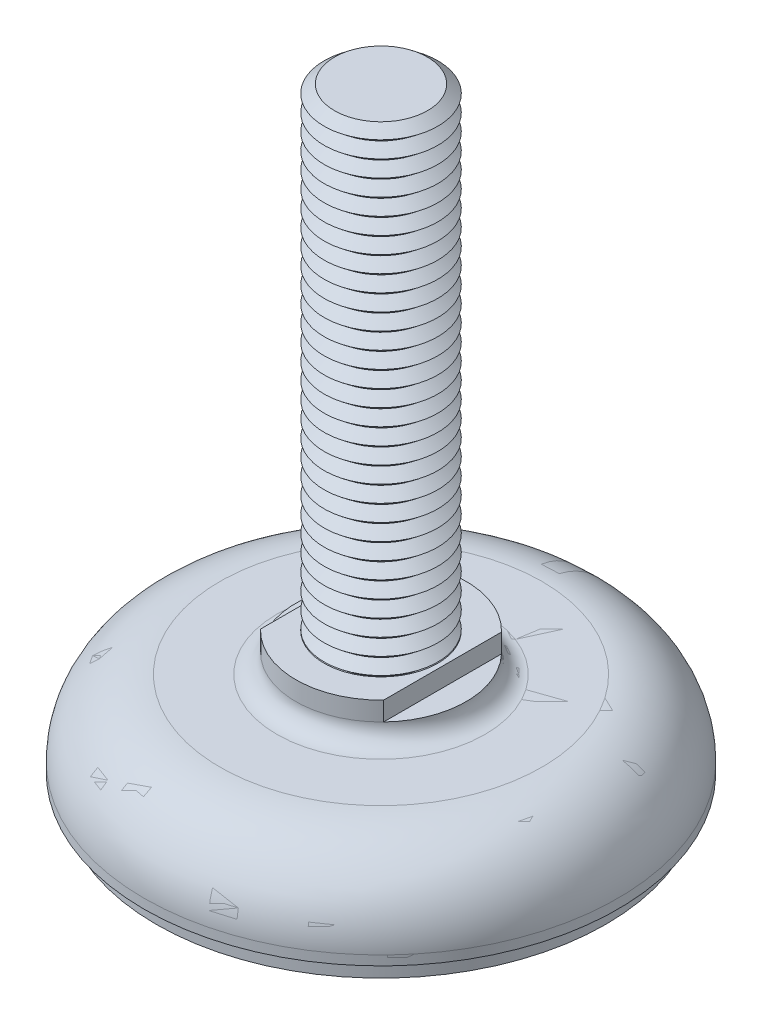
ISO-10303-21;
HEADER;
FILE_DESCRIPTION(('STEP AP214'),'2;1');
FILE_NAME('part.step','',(''),(''),'','','');
FILE_SCHEMA(('AUTOMOTIVE_DESIGN { 1 0 10303 214 1 1 1 1 }'));
ENDSEC;
DATA;
#1=APPLICATION_CONTEXT('core data for automotive mechanical design processes');
#2=APPLICATION_PROTOCOL_DEFINITION('international standard','automotive_design',2000,#1);
#3=PRODUCT_CONTEXT('',#1,'mechanical');
#4=PRODUCT('Part','Part','',(#3));
#5=PRODUCT_RELATED_PRODUCT_CATEGORY('part','',(#4));
#6=PRODUCT_DEFINITION_FORMATION('','',#4);
#7=PRODUCT_DEFINITION_CONTEXT('part definition',#1,'design');
#8=PRODUCT_DEFINITION('design','',#6,#7);
#9=PRODUCT_DEFINITION_SHAPE('','',#8);
#10=(LENGTH_UNIT() NAMED_UNIT(*) SI_UNIT(.MILLI.,.METRE.));
#11=(NAMED_UNIT(*) PLANE_ANGLE_UNIT() SI_UNIT($,.RADIAN.));
#12=(NAMED_UNIT(*) SI_UNIT($,.STERADIAN.) SOLID_ANGLE_UNIT());
#13=UNCERTAINTY_MEASURE_WITH_UNIT(LENGTH_MEASURE(1.E-05),#10,'distance_accuracy_value','');
#14=(GEOMETRIC_REPRESENTATION_CONTEXT(3) GLOBAL_UNCERTAINTY_ASSIGNED_CONTEXT((#13)) GLOBAL_UNIT_ASSIGNED_CONTEXT((#10,
#11,#12)) REPRESENTATION_CONTEXT('',''));
#15=CARTESIAN_POINT('',(0.,0.,0.));
#16=DIRECTION('',(0.,0.,1.));
#17=DIRECTION('',(1.,0.,0.));
#18=AXIS2_PLACEMENT_3D('',#15,#16,#17);
#19=CARTESIAN_POINT('',(0.,60.25,0.));
#20=DIRECTION('',(0.,-1.,0.));
#21=DIRECTION('',(0.998136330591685,0.,-0.0610234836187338));
#22=AXIS2_PLACEMENT_3D('',#19,#20,#21);
#23=CONICAL_SURFACE('',#22,4.90712535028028,0.895664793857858);
#24=CARTESIAN_POINT('',(0.,59.375,0.));
#25=DIRECTION('',(0.,-1.,0.));
#26=DIRECTION('',(0.998136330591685,0.,-0.0610234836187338));
#27=AXIS2_PLACEMENT_3D('',#24,#25,#26);
#28=CIRCLE('',#27,6.);
#29=CARTESIAN_POINT('',(5.98881798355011,59.375,-0.366140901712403));
#30=VERTEX_POINT('',#29);
#31=EDGE_CURVE('P0_E37',#30,#30,#28,.T.);
#32=ORIENTED_EDGE('',*,*,#31,.F.);
#33=EDGE_LOOP('',(#32));
#34=FACE_BOUND('',#33,.T.);
#35=CARTESIAN_POINT('',(0.,60.25,0.));
#36=DIRECTION('',(0.,-1.,0.));
#37=DIRECTION('',(0.998136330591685,0.,-0.0610234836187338));
#38=AXIS2_PLACEMENT_3D('',#35,#36,#37);
#39=CIRCLE('',#38,4.90712535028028);
#40=CARTESIAN_POINT('',(4.8979800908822,60.25,-0.299449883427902));
#41=VERTEX_POINT('',#40);
#42=EDGE_CURVE('P0_E25',#41,#41,#39,.T.);
#43=ORIENTED_EDGE('',*,*,#42,.T.);
#44=EDGE_LOOP('',(#43));
#45=FACE_BOUND('',#44,.T.);
#46=ADVANCED_FACE('P0_F14',(#34,#45),#23,.T.);
#47=CARTESIAN_POINT('',(0.,61.125,0.));
#48=DIRECTION('',(0.,1.,0.));
#49=DIRECTION('',(-0.998136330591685,0.,0.0610234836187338));
#50=AXIS2_PLACEMENT_3D('',#47,#48,#49);
#51=CONICAL_SURFACE('',#50,6.,0.895664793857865);
#52=ORIENTED_EDGE('',*,*,#42,.F.);
#53=EDGE_LOOP('',(#52));
#54=FACE_BOUND('',#53,.T.);
#55=CARTESIAN_POINT('',(0.,61.125,0.));
#56=DIRECTION('',(0.,-1.,0.));
#57=DIRECTION('',(0.998136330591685,0.,-0.0610234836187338));
#58=AXIS2_PLACEMENT_3D('',#55,#56,#57);
#59=CIRCLE('',#58,6.);
#60=CARTESIAN_POINT('',(5.98881798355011,61.125,-0.366140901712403));
#61=VERTEX_POINT('',#60);
#62=EDGE_CURVE('P0_E29',#61,#61,#59,.T.);
#63=ORIENTED_EDGE('',*,*,#62,.T.);
#64=EDGE_LOOP('',(#63));
#65=FACE_BOUND('',#64,.T.);
#66=ADVANCED_FACE('P0_F601',(#54,#65),#51,.T.);
#67=CARTESIAN_POINT('',(0.,62.,0.));
#68=DIRECTION('',(0.,1.,0.));
#69=DIRECTION('',(-0.998136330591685,0.,0.0610234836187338));
#70=AXIS2_PLACEMENT_3D('',#67,#68,#69);
#71=PLANE('',#70);
#72=CARTESIAN_POINT('',(0.,62.,0.));
#73=DIRECTION('',(0.,-1.,0.));
#74=DIRECTION('',(0.998136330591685,0.,-0.0610234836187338));
#75=AXIS2_PLACEMENT_3D('',#72,#73,#74);
#76=CIRCLE('',#75,4.90712535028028);
#77=CARTESIAN_POINT('',(4.8979800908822,62.,-0.299449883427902));
#78=VERTEX_POINT('',#77);
#79=EDGE_CURVE('P0_E21',#78,#78,#76,.T.);
#80=ORIENTED_EDGE('',*,*,#79,.F.);
#81=EDGE_LOOP('',(#80));
#82=FACE_BOUND('',#81,.T.);
#83=ADVANCED_FACE('P0_F607',(#82),#71,.T.);
#84=CARTESIAN_POINT('',(0.,62.,0.));
#85=DIRECTION('',(0.,-1.,0.));
#86=DIRECTION('',(0.998136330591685,0.,-0.0610234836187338));
#87=AXIS2_PLACEMENT_3D('',#84,#85,#86);
#88=CONICAL_SURFACE('',#87,4.90712535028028,0.895664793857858);
#89=ORIENTED_EDGE('',*,*,#62,.F.);
#90=EDGE_LOOP('',(#89));
#91=FACE_BOUND('',#90,.T.);
#92=ORIENTED_EDGE('',*,*,#79,.T.);
#93=EDGE_LOOP('',(#92));
#94=FACE_BOUND('',#93,.T.);
#95=ADVANCED_FACE('P0_F590',(#91,#94),#88,.T.);
#96=CARTESIAN_POINT('',(0.,58.5,0.));
#97=DIRECTION('',(0.,-1.,0.));
#98=DIRECTION('',(0.998136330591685,0.,-0.0610234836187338));
#99=AXIS2_PLACEMENT_3D('',#96,#97,#98);
#100=CONICAL_SURFACE('',#99,4.90712535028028,0.895664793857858);
#101=CARTESIAN_POINT('',(0.,57.625,0.));
#102=DIRECTION('',(0.,-1.,0.));
#103=DIRECTION('',(0.998136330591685,0.,-0.0610234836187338));
#104=AXIS2_PLACEMENT_3D('',#101,#102,#103);
#105=CIRCLE('',#104,6.);
#106=CARTESIAN_POINT('',(5.98881798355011,57.625,-0.366140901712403));
#107=VERTEX_POINT('',#106);
#108=EDGE_CURVE('P0_E43',#107,#107,#105,.T.);
#109=ORIENTED_EDGE('',*,*,#108,.F.);
#110=EDGE_LOOP('',(#109));
#111=FACE_BOUND('',#110,.T.);
#112=CARTESIAN_POINT('',(0.,58.5,0.));
#113=DIRECTION('',(0.,-1.,0.));
#114=DIRECTION('',(0.998136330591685,0.,-0.0610234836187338));
#115=AXIS2_PLACEMENT_3D('',#112,#113,#114);
#116=CIRCLE('',#115,4.90712535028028);
#117=CARTESIAN_POINT('',(4.8979800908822,58.5,-0.299449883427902));
#118=VERTEX_POINT('',#117);
#119=EDGE_CURVE('P0_E34',#118,#118,#116,.T.);
#120=ORIENTED_EDGE('',*,*,#119,.T.);
#121=EDGE_LOOP('',(#120));
#122=FACE_BOUND('',#121,.T.);
#123=ADVANCED_FACE('P0_F587',(#111,#122),#100,.T.);
#124=CARTESIAN_POINT('',(0.,59.375,0.));
#125=DIRECTION('',(0.,1.,0.));
#126=DIRECTION('',(-0.998136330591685,0.,0.0610234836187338));
#127=AXIS2_PLACEMENT_3D('',#124,#125,#126);
#128=CONICAL_SURFACE('',#127,6.,0.895664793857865);
#129=ORIENTED_EDGE('',*,*,#119,.F.);
#130=EDGE_LOOP('',(#129));
#131=FACE_BOUND('',#130,.T.);
#132=ORIENTED_EDGE('',*,*,#31,.T.);
#133=EDGE_LOOP('',(#132));
#134=FACE_BOUND('',#133,.T.);
#135=ADVANCED_FACE('P0_F578',(#131,#134),#128,.T.);
#136=CARTESIAN_POINT('',(0.,56.75,0.));
#137=DIRECTION('',(0.,-1.,0.));
#138=DIRECTION('',(0.998136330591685,0.,-0.0610234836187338));
#139=AXIS2_PLACEMENT_3D('',#136,#137,#138);
#140=CONICAL_SURFACE('',#139,4.90712535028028,0.895664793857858);
#141=CARTESIAN_POINT('',(0.,55.875,0.));
#142=DIRECTION('',(0.,-1.,0.));
#143=DIRECTION('',(0.998136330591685,0.,-0.0610234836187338));
#144=AXIS2_PLACEMENT_3D('',#141,#142,#143);
#145=CIRCLE('',#144,6.);
#146=CARTESIAN_POINT('',(5.98881798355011,55.875,-0.366140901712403));
#147=VERTEX_POINT('',#146);
#148=EDGE_CURVE('P0_E49',#147,#147,#145,.T.);
#149=ORIENTED_EDGE('',*,*,#148,.F.);
#150=EDGE_LOOP('',(#149));
#151=FACE_BOUND('',#150,.T.);
#152=CARTESIAN_POINT('',(0.,56.75,0.));
#153=DIRECTION('',(0.,-1.,0.));
#154=DIRECTION('',(0.998136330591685,0.,-0.0610234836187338));
#155=AXIS2_PLACEMENT_3D('',#152,#153,#154);
#156=CIRCLE('',#155,4.90712535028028);
#157=CARTESIAN_POINT('',(4.8979800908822,56.75,-0.299449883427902));
#158=VERTEX_POINT('',#157);
#159=EDGE_CURVE('P0_E40',#158,#158,#156,.T.);
#160=ORIENTED_EDGE('',*,*,#159,.T.);
#161=EDGE_LOOP('',(#160));
#162=FACE_BOUND('',#161,.T.);
#163=ADVANCED_FACE('P0_F575',(#151,#162),#140,.T.);
#164=CARTESIAN_POINT('',(0.,57.625,0.));
#165=DIRECTION('',(0.,1.,0.));
#166=DIRECTION('',(-0.998136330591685,0.,0.0610234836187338));
#167=AXIS2_PLACEMENT_3D('',#164,#165,#166);
#168=CONICAL_SURFACE('',#167,6.,0.895664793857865);
#169=ORIENTED_EDGE('',*,*,#159,.F.);
#170=EDGE_LOOP('',(#169));
#171=FACE_BOUND('',#170,.T.);
#172=ORIENTED_EDGE('',*,*,#108,.T.);
#173=EDGE_LOOP('',(#172));
#174=FACE_BOUND('',#173,.T.);
#175=ADVANCED_FACE('P0_F566',(#171,#174),#168,.T.);
#176=CARTESIAN_POINT('',(0.,55.,0.));
#177=DIRECTION('',(0.,-1.,0.));
#178=DIRECTION('',(0.998136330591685,0.,-0.0610234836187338));
#179=AXIS2_PLACEMENT_3D('',#176,#177,#178);
#180=CONICAL_SURFACE('',#179,4.90712535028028,0.895664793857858);
#181=CARTESIAN_POINT('',(0.,54.125,0.));
#182=DIRECTION('',(0.,-1.,0.));
#183=DIRECTION('',(0.998136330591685,0.,-0.0610234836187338));
#184=AXIS2_PLACEMENT_3D('',#181,#182,#183);
#185=CIRCLE('',#184,6.);
#186=CARTESIAN_POINT('',(5.98881798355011,54.125,-0.366140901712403));
#187=VERTEX_POINT('',#186);
#188=EDGE_CURVE('P0_E55',#187,#187,#185,.T.);
#189=ORIENTED_EDGE('',*,*,#188,.F.);
#190=EDGE_LOOP('',(#189));
#191=FACE_BOUND('',#190,.T.);
#192=CARTESIAN_POINT('',(0.,55.,0.));
#193=DIRECTION('',(0.,-1.,0.));
#194=DIRECTION('',(0.998136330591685,0.,-0.0610234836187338));
#195=AXIS2_PLACEMENT_3D('',#192,#193,#194);
#196=CIRCLE('',#195,4.90712535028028);
#197=CARTESIAN_POINT('',(4.8979800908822,55.,-0.299449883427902));
#198=VERTEX_POINT('',#197);
#199=EDGE_CURVE('P0_E46',#198,#198,#196,.T.);
#200=ORIENTED_EDGE('',*,*,#199,.T.);
#201=EDGE_LOOP('',(#200));
#202=FACE_BOUND('',#201,.T.);
#203=ADVANCED_FACE('P0_F563',(#191,#202),#180,.T.);
#204=CARTESIAN_POINT('',(0.,55.875,0.));
#205=DIRECTION('',(0.,1.,0.));
#206=DIRECTION('',(-0.998136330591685,0.,0.0610234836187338));
#207=AXIS2_PLACEMENT_3D('',#204,#205,#206);
#208=CONICAL_SURFACE('',#207,6.,0.895664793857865);
#209=ORIENTED_EDGE('',*,*,#199,.F.);
#210=EDGE_LOOP('',(#209));
#211=FACE_BOUND('',#210,.T.);
#212=ORIENTED_EDGE('',*,*,#148,.T.);
#213=EDGE_LOOP('',(#212));
#214=FACE_BOUND('',#213,.T.);
#215=ADVANCED_FACE('P0_F554',(#211,#214),#208,.T.);
#216=CARTESIAN_POINT('',(0.,53.25,0.));
#217=DIRECTION('',(0.,-1.,0.));
#218=DIRECTION('',(0.998136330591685,0.,-0.0610234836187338));
#219=AXIS2_PLACEMENT_3D('',#216,#217,#218);
#220=CONICAL_SURFACE('',#219,4.90712535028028,0.895664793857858);
#221=CARTESIAN_POINT('',(0.,52.375,0.));
#222=DIRECTION('',(0.,-1.,0.));
#223=DIRECTION('',(0.998136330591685,0.,-0.0610234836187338));
#224=AXIS2_PLACEMENT_3D('',#221,#222,#223);
#225=CIRCLE('',#224,6.);
#226=CARTESIAN_POINT('',(5.98881798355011,52.375,-0.366140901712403));
#227=VERTEX_POINT('',#226);
#228=EDGE_CURVE('P0_E61',#227,#227,#225,.T.);
#229=ORIENTED_EDGE('',*,*,#228,.F.);
#230=EDGE_LOOP('',(#229));
#231=FACE_BOUND('',#230,.T.);
#232=CARTESIAN_POINT('',(0.,53.25,0.));
#233=DIRECTION('',(0.,-1.,0.));
#234=DIRECTION('',(0.998136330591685,0.,-0.0610234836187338));
#235=AXIS2_PLACEMENT_3D('',#232,#233,#234);
#236=CIRCLE('',#235,4.90712535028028);
#237=CARTESIAN_POINT('',(4.8979800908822,53.25,-0.299449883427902));
#238=VERTEX_POINT('',#237);
#239=EDGE_CURVE('P0_E52',#238,#238,#236,.T.);
#240=ORIENTED_EDGE('',*,*,#239,.T.);
#241=EDGE_LOOP('',(#240));
#242=FACE_BOUND('',#241,.T.);
#243=ADVANCED_FACE('P0_F551',(#231,#242),#220,.T.);
#244=CARTESIAN_POINT('',(0.,54.125,0.));
#245=DIRECTION('',(0.,1.,0.));
#246=DIRECTION('',(-0.998136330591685,0.,0.0610234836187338));
#247=AXIS2_PLACEMENT_3D('',#244,#245,#246);
#248=CONICAL_SURFACE('',#247,6.,0.895664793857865);
#249=ORIENTED_EDGE('',*,*,#239,.F.);
#250=EDGE_LOOP('',(#249));
#251=FACE_BOUND('',#250,.T.);
#252=ORIENTED_EDGE('',*,*,#188,.T.);
#253=EDGE_LOOP('',(#252));
#254=FACE_BOUND('',#253,.T.);
#255=ADVANCED_FACE('P0_F542',(#251,#254),#248,.T.);
#256=CARTESIAN_POINT('',(0.,51.5,0.));
#257=DIRECTION('',(0.,-1.,0.));
#258=DIRECTION('',(0.998136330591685,0.,-0.0610234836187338));
#259=AXIS2_PLACEMENT_3D('',#256,#257,#258);
#260=CONICAL_SURFACE('',#259,4.90712535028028,0.895664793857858);
#261=CARTESIAN_POINT('',(0.,50.625,0.));
#262=DIRECTION('',(0.,-1.,0.));
#263=DIRECTION('',(0.998136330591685,0.,-0.0610234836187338));
#264=AXIS2_PLACEMENT_3D('',#261,#262,#263);
#265=CIRCLE('',#264,6.);
#266=CARTESIAN_POINT('',(5.98881798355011,50.625,-0.366140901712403));
#267=VERTEX_POINT('',#266);
#268=EDGE_CURVE('P0_E67',#267,#267,#265,.T.);
#269=ORIENTED_EDGE('',*,*,#268,.F.);
#270=EDGE_LOOP('',(#269));
#271=FACE_BOUND('',#270,.T.);
#272=CARTESIAN_POINT('',(0.,51.5,0.));
#273=DIRECTION('',(0.,-1.,0.));
#274=DIRECTION('',(0.998136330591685,0.,-0.0610234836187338));
#275=AXIS2_PLACEMENT_3D('',#272,#273,#274);
#276=CIRCLE('',#275,4.90712535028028);
#277=CARTESIAN_POINT('',(4.8979800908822,51.5,-0.299449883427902));
#278=VERTEX_POINT('',#277);
#279=EDGE_CURVE('P0_E58',#278,#278,#276,.T.);
#280=ORIENTED_EDGE('',*,*,#279,.T.);
#281=EDGE_LOOP('',(#280));
#282=FACE_BOUND('',#281,.T.);
#283=ADVANCED_FACE('P0_F539',(#271,#282),#260,.T.);
#284=CARTESIAN_POINT('',(0.,52.375,0.));
#285=DIRECTION('',(0.,1.,0.));
#286=DIRECTION('',(-0.998136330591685,0.,0.0610234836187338));
#287=AXIS2_PLACEMENT_3D('',#284,#285,#286);
#288=CONICAL_SURFACE('',#287,6.,0.895664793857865);
#289=ORIENTED_EDGE('',*,*,#279,.F.);
#290=EDGE_LOOP('',(#289));
#291=FACE_BOUND('',#290,.T.);
#292=ORIENTED_EDGE('',*,*,#228,.T.);
#293=EDGE_LOOP('',(#292));
#294=FACE_BOUND('',#293,.T.);
#295=ADVANCED_FACE('P0_F530',(#291,#294),#288,.T.);
#296=CARTESIAN_POINT('',(0.,49.75,0.));
#297=DIRECTION('',(0.,-1.,0.));
#298=DIRECTION('',(0.998136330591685,0.,-0.0610234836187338));
#299=AXIS2_PLACEMENT_3D('',#296,#297,#298);
#300=CONICAL_SURFACE('',#299,4.90712535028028,0.895664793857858);
#301=CARTESIAN_POINT('',(0.,48.875,0.));
#302=DIRECTION('',(0.,-1.,0.));
#303=DIRECTION('',(0.998136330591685,0.,-0.0610234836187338));
#304=AXIS2_PLACEMENT_3D('',#301,#302,#303);
#305=CIRCLE('',#304,6.);
#306=CARTESIAN_POINT('',(5.98881798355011,48.875,-0.366140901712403));
#307=VERTEX_POINT('',#306);
#308=EDGE_CURVE('P0_E73',#307,#307,#305,.T.);
#309=ORIENTED_EDGE('',*,*,#308,.F.);
#310=EDGE_LOOP('',(#309));
#311=FACE_BOUND('',#310,.T.);
#312=CARTESIAN_POINT('',(0.,49.75,0.));
#313=DIRECTION('',(0.,-1.,0.));
#314=DIRECTION('',(0.998136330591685,0.,-0.0610234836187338));
#315=AXIS2_PLACEMENT_3D('',#312,#313,#314);
#316=CIRCLE('',#315,4.90712535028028);
#317=CARTESIAN_POINT('',(4.8979800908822,49.75,-0.299449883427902));
#318=VERTEX_POINT('',#317);
#319=EDGE_CURVE('P0_E64',#318,#318,#316,.T.);
#320=ORIENTED_EDGE('',*,*,#319,.T.);
#321=EDGE_LOOP('',(#320));
#322=FACE_BOUND('',#321,.T.);
#323=ADVANCED_FACE('P0_F527',(#311,#322),#300,.T.);
#324=CARTESIAN_POINT('',(0.,50.625,0.));
#325=DIRECTION('',(0.,1.,0.));
#326=DIRECTION('',(-0.998136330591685,0.,0.0610234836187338));
#327=AXIS2_PLACEMENT_3D('',#324,#325,#326);
#328=CONICAL_SURFACE('',#327,6.,0.895664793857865);
#329=ORIENTED_EDGE('',*,*,#319,.F.);
#330=EDGE_LOOP('',(#329));
#331=FACE_BOUND('',#330,.T.);
#332=ORIENTED_EDGE('',*,*,#268,.T.);
#333=EDGE_LOOP('',(#332));
#334=FACE_BOUND('',#333,.T.);
#335=ADVANCED_FACE('P0_F518',(#331,#334),#328,.T.);
#336=CARTESIAN_POINT('',(0.,48.,0.));
#337=DIRECTION('',(0.,-1.,0.));
#338=DIRECTION('',(0.998136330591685,0.,-0.0610234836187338));
#339=AXIS2_PLACEMENT_3D('',#336,#337,#338);
#340=CONICAL_SURFACE('',#339,4.90712535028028,0.895664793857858);
#341=CARTESIAN_POINT('',(0.,47.125,0.));
#342=DIRECTION('',(0.,-1.,0.));
#343=DIRECTION('',(0.998136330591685,0.,-0.0610234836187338));
#344=AXIS2_PLACEMENT_3D('',#341,#342,#343);
#345=CIRCLE('',#344,6.);
#346=CARTESIAN_POINT('',(5.98881798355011,47.125,-0.366140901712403));
#347=VERTEX_POINT('',#346);
#348=EDGE_CURVE('P0_E79',#347,#347,#345,.T.);
#349=ORIENTED_EDGE('',*,*,#348,.F.);
#350=EDGE_LOOP('',(#349));
#351=FACE_BOUND('',#350,.T.);
#352=CARTESIAN_POINT('',(0.,48.,0.));
#353=DIRECTION('',(0.,-1.,0.));
#354=DIRECTION('',(0.998136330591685,0.,-0.0610234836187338));
#355=AXIS2_PLACEMENT_3D('',#352,#353,#354);
#356=CIRCLE('',#355,4.90712535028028);
#357=CARTESIAN_POINT('',(4.8979800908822,48.,-0.299449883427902));
#358=VERTEX_POINT('',#357);
#359=EDGE_CURVE('P0_E70',#358,#358,#356,.T.);
#360=ORIENTED_EDGE('',*,*,#359,.T.);
#361=EDGE_LOOP('',(#360));
#362=FACE_BOUND('',#361,.T.);
#363=ADVANCED_FACE('P0_F515',(#351,#362),#340,.T.);
#364=CARTESIAN_POINT('',(0.,48.875,0.));
#365=DIRECTION('',(0.,1.,0.));
#366=DIRECTION('',(-0.998136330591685,0.,0.0610234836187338));
#367=AXIS2_PLACEMENT_3D('',#364,#365,#366);
#368=CONICAL_SURFACE('',#367,6.,0.895664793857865);
#369=ORIENTED_EDGE('',*,*,#359,.F.);
#370=EDGE_LOOP('',(#369));
#371=FACE_BOUND('',#370,.T.);
#372=ORIENTED_EDGE('',*,*,#308,.T.);
#373=EDGE_LOOP('',(#372));
#374=FACE_BOUND('',#373,.T.);
#375=ADVANCED_FACE('P0_F506',(#371,#374),#368,.T.);
#376=CARTESIAN_POINT('',(0.,46.25,0.));
#377=DIRECTION('',(0.,-1.,0.));
#378=DIRECTION('',(0.998136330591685,0.,-0.0610234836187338));
#379=AXIS2_PLACEMENT_3D('',#376,#377,#378);
#380=CONICAL_SURFACE('',#379,4.90712535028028,0.895664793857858);
#381=CARTESIAN_POINT('',(0.,45.375,0.));
#382=DIRECTION('',(0.,-1.,0.));
#383=DIRECTION('',(0.998136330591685,0.,-0.0610234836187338));
#384=AXIS2_PLACEMENT_3D('',#381,#382,#383);
#385=CIRCLE('',#384,6.);
#386=CARTESIAN_POINT('',(5.98881798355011,45.375,-0.366140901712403));
#387=VERTEX_POINT('',#386);
#388=EDGE_CURVE('P0_E85',#387,#387,#385,.T.);
#389=ORIENTED_EDGE('',*,*,#388,.F.);
#390=EDGE_LOOP('',(#389));
#391=FACE_BOUND('',#390,.T.);
#392=CARTESIAN_POINT('',(0.,46.25,0.));
#393=DIRECTION('',(0.,-1.,0.));
#394=DIRECTION('',(0.998136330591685,0.,-0.0610234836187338));
#395=AXIS2_PLACEMENT_3D('',#392,#393,#394);
#396=CIRCLE('',#395,4.90712535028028);
#397=CARTESIAN_POINT('',(4.8979800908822,46.25,-0.299449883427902));
#398=VERTEX_POINT('',#397);
#399=EDGE_CURVE('P0_E76',#398,#398,#396,.T.);
#400=ORIENTED_EDGE('',*,*,#399,.T.);
#401=EDGE_LOOP('',(#400));
#402=FACE_BOUND('',#401,.T.);
#403=ADVANCED_FACE('P0_F503',(#391,#402),#380,.T.);
#404=CARTESIAN_POINT('',(0.,47.125,0.));
#405=DIRECTION('',(0.,1.,0.));
#406=DIRECTION('',(-0.998136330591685,0.,0.0610234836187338));
#407=AXIS2_PLACEMENT_3D('',#404,#405,#406);
#408=CONICAL_SURFACE('',#407,6.,0.895664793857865);
#409=ORIENTED_EDGE('',*,*,#399,.F.);
#410=EDGE_LOOP('',(#409));
#411=FACE_BOUND('',#410,.T.);
#412=ORIENTED_EDGE('',*,*,#348,.T.);
#413=EDGE_LOOP('',(#412));
#414=FACE_BOUND('',#413,.T.);
#415=ADVANCED_FACE('P0_F494',(#411,#414),#408,.T.);
#416=CARTESIAN_POINT('',(0.,44.5,0.));
#417=DIRECTION('',(0.,-1.,0.));
#418=DIRECTION('',(0.998136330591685,0.,-0.0610234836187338));
#419=AXIS2_PLACEMENT_3D('',#416,#417,#418);
#420=CONICAL_SURFACE('',#419,4.90712535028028,0.895664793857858);
#421=CARTESIAN_POINT('',(0.,43.625,0.));
#422=DIRECTION('',(0.,-1.,0.));
#423=DIRECTION('',(0.998136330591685,0.,-0.0610234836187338));
#424=AXIS2_PLACEMENT_3D('',#421,#422,#423);
#425=CIRCLE('',#424,6.);
#426=CARTESIAN_POINT('',(5.98881798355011,43.625,-0.366140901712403));
#427=VERTEX_POINT('',#426);
#428=EDGE_CURVE('P0_E91',#427,#427,#425,.T.);
#429=ORIENTED_EDGE('',*,*,#428,.F.);
#430=EDGE_LOOP('',(#429));
#431=FACE_BOUND('',#430,.T.);
#432=CARTESIAN_POINT('',(0.,44.5,0.));
#433=DIRECTION('',(0.,-1.,0.));
#434=DIRECTION('',(0.998136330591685,0.,-0.0610234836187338));
#435=AXIS2_PLACEMENT_3D('',#432,#433,#434);
#436=CIRCLE('',#435,4.90712535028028);
#437=CARTESIAN_POINT('',(4.8979800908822,44.5,-0.299449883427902));
#438=VERTEX_POINT('',#437);
#439=EDGE_CURVE('P0_E82',#438,#438,#436,.T.);
#440=ORIENTED_EDGE('',*,*,#439,.T.);
#441=EDGE_LOOP('',(#440));
#442=FACE_BOUND('',#441,.T.);
#443=ADVANCED_FACE('P0_F491',(#431,#442),#420,.T.);
#444=CARTESIAN_POINT('',(0.,45.375,0.));
#445=DIRECTION('',(0.,1.,0.));
#446=DIRECTION('',(-0.998136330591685,0.,0.0610234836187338));
#447=AXIS2_PLACEMENT_3D('',#444,#445,#446);
#448=CONICAL_SURFACE('',#447,6.,0.895664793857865);
#449=ORIENTED_EDGE('',*,*,#439,.F.);
#450=EDGE_LOOP('',(#449));
#451=FACE_BOUND('',#450,.T.);
#452=ORIENTED_EDGE('',*,*,#388,.T.);
#453=EDGE_LOOP('',(#452));
#454=FACE_BOUND('',#453,.T.);
#455=ADVANCED_FACE('P0_F482',(#451,#454),#448,.T.);
#456=CARTESIAN_POINT('',(0.,42.75,0.));
#457=DIRECTION('',(0.,-1.,0.));
#458=DIRECTION('',(0.998136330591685,0.,-0.0610234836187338));
#459=AXIS2_PLACEMENT_3D('',#456,#457,#458);
#460=CONICAL_SURFACE('',#459,4.90712535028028,0.895664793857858);
#461=CARTESIAN_POINT('',(0.,41.875,0.));
#462=DIRECTION('',(0.,-1.,0.));
#463=DIRECTION('',(0.998136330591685,0.,-0.0610234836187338));
#464=AXIS2_PLACEMENT_3D('',#461,#462,#463);
#465=CIRCLE('',#464,6.);
#466=CARTESIAN_POINT('',(5.98881798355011,41.875,-0.366140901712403));
#467=VERTEX_POINT('',#466);
#468=EDGE_CURVE('P0_E97',#467,#467,#465,.T.);
#469=ORIENTED_EDGE('',*,*,#468,.F.);
#470=EDGE_LOOP('',(#469));
#471=FACE_BOUND('',#470,.T.);
#472=CARTESIAN_POINT('',(0.,42.75,0.));
#473=DIRECTION('',(0.,-1.,0.));
#474=DIRECTION('',(0.998136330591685,0.,-0.0610234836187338));
#475=AXIS2_PLACEMENT_3D('',#472,#473,#474);
#476=CIRCLE('',#475,4.90712535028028);
#477=CARTESIAN_POINT('',(4.8979800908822,42.75,-0.299449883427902));
#478=VERTEX_POINT('',#477);
#479=EDGE_CURVE('P0_E88',#478,#478,#476,.T.);
#480=ORIENTED_EDGE('',*,*,#479,.T.);
#481=EDGE_LOOP('',(#480));
#482=FACE_BOUND('',#481,.T.);
#483=ADVANCED_FACE('P0_F479',(#471,#482),#460,.T.);
#484=CARTESIAN_POINT('',(0.,43.625,0.));
#485=DIRECTION('',(0.,1.,0.));
#486=DIRECTION('',(-0.998136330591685,0.,0.0610234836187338));
#487=AXIS2_PLACEMENT_3D('',#484,#485,#486);
#488=CONICAL_SURFACE('',#487,6.,0.895664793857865);
#489=ORIENTED_EDGE('',*,*,#479,.F.);
#490=EDGE_LOOP('',(#489));
#491=FACE_BOUND('',#490,.T.);
#492=ORIENTED_EDGE('',*,*,#428,.T.);
#493=EDGE_LOOP('',(#492));
#494=FACE_BOUND('',#493,.T.);
#495=ADVANCED_FACE('P0_F470',(#491,#494),#488,.T.);
#496=CARTESIAN_POINT('',(0.,41.,0.));
#497=DIRECTION('',(0.,-1.,0.));
#498=DIRECTION('',(0.998136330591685,0.,-0.0610234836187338));
#499=AXIS2_PLACEMENT_3D('',#496,#497,#498);
#500=CONICAL_SURFACE('',#499,4.90712535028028,0.895664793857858);
#501=CARTESIAN_POINT('',(0.,40.125,0.));
#502=DIRECTION('',(0.,-1.,0.));
#503=DIRECTION('',(0.998136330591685,0.,-0.0610234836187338));
#504=AXIS2_PLACEMENT_3D('',#501,#502,#503);
#505=CIRCLE('',#504,6.);
#506=CARTESIAN_POINT('',(5.98881798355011,40.125,-0.366140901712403));
#507=VERTEX_POINT('',#506);
#508=EDGE_CURVE('P0_E103',#507,#507,#505,.T.);
#509=ORIENTED_EDGE('',*,*,#508,.F.);
#510=EDGE_LOOP('',(#509));
#511=FACE_BOUND('',#510,.T.);
#512=CARTESIAN_POINT('',(0.,41.,0.));
#513=DIRECTION('',(0.,-1.,0.));
#514=DIRECTION('',(0.998136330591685,0.,-0.0610234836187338));
#515=AXIS2_PLACEMENT_3D('',#512,#513,#514);
#516=CIRCLE('',#515,4.90712535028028);
#517=CARTESIAN_POINT('',(4.8979800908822,41.,-0.299449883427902));
#518=VERTEX_POINT('',#517);
#519=EDGE_CURVE('P0_E94',#518,#518,#516,.T.);
#520=ORIENTED_EDGE('',*,*,#519,.T.);
#521=EDGE_LOOP('',(#520));
#522=FACE_BOUND('',#521,.T.);
#523=ADVANCED_FACE('P0_F467',(#511,#522),#500,.T.);
#524=CARTESIAN_POINT('',(0.,41.875,0.));
#525=DIRECTION('',(0.,1.,0.));
#526=DIRECTION('',(-0.998136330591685,0.,0.0610234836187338));
#527=AXIS2_PLACEMENT_3D('',#524,#525,#526);
#528=CONICAL_SURFACE('',#527,6.,0.895664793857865);
#529=ORIENTED_EDGE('',*,*,#519,.F.);
#530=EDGE_LOOP('',(#529));
#531=FACE_BOUND('',#530,.T.);
#532=ORIENTED_EDGE('',*,*,#468,.T.);
#533=EDGE_LOOP('',(#532));
#534=FACE_BOUND('',#533,.T.);
#535=ADVANCED_FACE('P0_F458',(#531,#534),#528,.T.);
#536=CARTESIAN_POINT('',(0.,39.25,0.));
#537=DIRECTION('',(0.,-1.,0.));
#538=DIRECTION('',(0.998136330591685,0.,-0.0610234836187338));
#539=AXIS2_PLACEMENT_3D('',#536,#537,#538);
#540=CONICAL_SURFACE('',#539,4.90712535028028,0.895664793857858);
#541=CARTESIAN_POINT('',(0.,38.375,0.));
#542=DIRECTION('',(0.,-1.,0.));
#543=DIRECTION('',(0.998136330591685,0.,-0.0610234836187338));
#544=AXIS2_PLACEMENT_3D('',#541,#542,#543);
#545=CIRCLE('',#544,6.);
#546=CARTESIAN_POINT('',(5.98881798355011,38.375,-0.366140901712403));
#547=VERTEX_POINT('',#546);
#548=EDGE_CURVE('P0_E109',#547,#547,#545,.T.);
#549=ORIENTED_EDGE('',*,*,#548,.F.);
#550=EDGE_LOOP('',(#549));
#551=FACE_BOUND('',#550,.T.);
#552=CARTESIAN_POINT('',(0.,39.25,0.));
#553=DIRECTION('',(0.,-1.,0.));
#554=DIRECTION('',(0.998136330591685,0.,-0.0610234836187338));
#555=AXIS2_PLACEMENT_3D('',#552,#553,#554);
#556=CIRCLE('',#555,4.90712535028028);
#557=CARTESIAN_POINT('',(4.8979800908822,39.25,-0.299449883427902));
#558=VERTEX_POINT('',#557);
#559=EDGE_CURVE('P0_E100',#558,#558,#556,.T.);
#560=ORIENTED_EDGE('',*,*,#559,.T.);
#561=EDGE_LOOP('',(#560));
#562=FACE_BOUND('',#561,.T.);
#563=ADVANCED_FACE('P0_F455',(#551,#562),#540,.T.);
#564=CARTESIAN_POINT('',(0.,40.125,0.));
#565=DIRECTION('',(0.,1.,0.));
#566=DIRECTION('',(-0.998136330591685,0.,0.0610234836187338));
#567=AXIS2_PLACEMENT_3D('',#564,#565,#566);
#568=CONICAL_SURFACE('',#567,6.,0.895664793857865);
#569=ORIENTED_EDGE('',*,*,#559,.F.);
#570=EDGE_LOOP('',(#569));
#571=FACE_BOUND('',#570,.T.);
#572=ORIENTED_EDGE('',*,*,#508,.T.);
#573=EDGE_LOOP('',(#572));
#574=FACE_BOUND('',#573,.T.);
#575=ADVANCED_FACE('P0_F446',(#571,#574),#568,.T.);
#576=CARTESIAN_POINT('',(0.,37.5,0.));
#577=DIRECTION('',(0.,-1.,0.));
#578=DIRECTION('',(0.998136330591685,0.,-0.0610234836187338));
#579=AXIS2_PLACEMENT_3D('',#576,#577,#578);
#580=CONICAL_SURFACE('',#579,4.90712535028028,0.895664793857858);
#581=CARTESIAN_POINT('',(0.,36.625,0.));
#582=DIRECTION('',(0.,-1.,0.));
#583=DIRECTION('',(0.998136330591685,0.,-0.0610234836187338));
#584=AXIS2_PLACEMENT_3D('',#581,#582,#583);
#585=CIRCLE('',#584,6.);
#586=CARTESIAN_POINT('',(5.98881798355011,36.625,-0.366140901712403));
#587=VERTEX_POINT('',#586);
#588=EDGE_CURVE('P0_E115',#587,#587,#585,.T.);
#589=ORIENTED_EDGE('',*,*,#588,.F.);
#590=EDGE_LOOP('',(#589));
#591=FACE_BOUND('',#590,.T.);
#592=CARTESIAN_POINT('',(0.,37.5,0.));
#593=DIRECTION('',(0.,-1.,0.));
#594=DIRECTION('',(0.998136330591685,0.,-0.0610234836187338));
#595=AXIS2_PLACEMENT_3D('',#592,#593,#594);
#596=CIRCLE('',#595,4.90712535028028);
#597=CARTESIAN_POINT('',(4.8979800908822,37.5,-0.299449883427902));
#598=VERTEX_POINT('',#597);
#599=EDGE_CURVE('P0_E106',#598,#598,#596,.T.);
#600=ORIENTED_EDGE('',*,*,#599,.T.);
#601=EDGE_LOOP('',(#600));
#602=FACE_BOUND('',#601,.T.);
#603=ADVANCED_FACE('P0_F443',(#591,#602),#580,.T.);
#604=CARTESIAN_POINT('',(0.,38.375,0.));
#605=DIRECTION('',(0.,1.,0.));
#606=DIRECTION('',(-0.998136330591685,0.,0.0610234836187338));
#607=AXIS2_PLACEMENT_3D('',#604,#605,#606);
#608=CONICAL_SURFACE('',#607,6.,0.895664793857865);
#609=ORIENTED_EDGE('',*,*,#599,.F.);
#610=EDGE_LOOP('',(#609));
#611=FACE_BOUND('',#610,.T.);
#612=ORIENTED_EDGE('',*,*,#548,.T.);
#613=EDGE_LOOP('',(#612));
#614=FACE_BOUND('',#613,.T.);
#615=ADVANCED_FACE('P0_F434',(#611,#614),#608,.T.);
#616=CARTESIAN_POINT('',(0.,35.75,0.));
#617=DIRECTION('',(0.,-1.,0.));
#618=DIRECTION('',(0.998136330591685,0.,-0.0610234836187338));
#619=AXIS2_PLACEMENT_3D('',#616,#617,#618);
#620=CONICAL_SURFACE('',#619,4.90712535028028,0.895664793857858);
#621=CARTESIAN_POINT('',(0.,34.875,0.));
#622=DIRECTION('',(0.,-1.,0.));
#623=DIRECTION('',(0.998136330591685,0.,-0.0610234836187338));
#624=AXIS2_PLACEMENT_3D('',#621,#622,#623);
#625=CIRCLE('',#624,6.);
#626=CARTESIAN_POINT('',(5.98881798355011,34.875,-0.366140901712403));
#627=VERTEX_POINT('',#626);
#628=EDGE_CURVE('P0_E121',#627,#627,#625,.T.);
#629=ORIENTED_EDGE('',*,*,#628,.F.);
#630=EDGE_LOOP('',(#629));
#631=FACE_BOUND('',#630,.T.);
#632=CARTESIAN_POINT('',(0.,35.75,0.));
#633=DIRECTION('',(0.,-1.,0.));
#634=DIRECTION('',(0.998136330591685,0.,-0.0610234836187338));
#635=AXIS2_PLACEMENT_3D('',#632,#633,#634);
#636=CIRCLE('',#635,4.90712535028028);
#637=CARTESIAN_POINT('',(4.8979800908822,35.75,-0.299449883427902));
#638=VERTEX_POINT('',#637);
#639=EDGE_CURVE('P0_E112',#638,#638,#636,.T.);
#640=ORIENTED_EDGE('',*,*,#639,.T.);
#641=EDGE_LOOP('',(#640));
#642=FACE_BOUND('',#641,.T.);
#643=ADVANCED_FACE('P0_F431',(#631,#642),#620,.T.);
#644=CARTESIAN_POINT('',(0.,36.625,0.));
#645=DIRECTION('',(0.,1.,0.));
#646=DIRECTION('',(-0.998136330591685,0.,0.0610234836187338));
#647=AXIS2_PLACEMENT_3D('',#644,#645,#646);
#648=CONICAL_SURFACE('',#647,6.,0.895664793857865);
#649=ORIENTED_EDGE('',*,*,#639,.F.);
#650=EDGE_LOOP('',(#649));
#651=FACE_BOUND('',#650,.T.);
#652=ORIENTED_EDGE('',*,*,#588,.T.);
#653=EDGE_LOOP('',(#652));
#654=FACE_BOUND('',#653,.T.);
#655=ADVANCED_FACE('P0_F422',(#651,#654),#648,.T.);
#656=CARTESIAN_POINT('',(0.,34.,0.));
#657=DIRECTION('',(0.,-1.,0.));
#658=DIRECTION('',(0.998136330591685,0.,-0.0610234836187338));
#659=AXIS2_PLACEMENT_3D('',#656,#657,#658);
#660=CONICAL_SURFACE('',#659,4.90712535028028,0.895664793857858);
#661=CARTESIAN_POINT('',(0.,33.125,0.));
#662=DIRECTION('',(0.,-1.,0.));
#663=DIRECTION('',(0.998136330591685,0.,-0.0610234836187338));
#664=AXIS2_PLACEMENT_3D('',#661,#662,#663);
#665=CIRCLE('',#664,6.);
#666=CARTESIAN_POINT('',(5.98881798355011,33.125,-0.366140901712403));
#667=VERTEX_POINT('',#666);
#668=EDGE_CURVE('P0_E127',#667,#667,#665,.T.);
#669=ORIENTED_EDGE('',*,*,#668,.F.);
#670=EDGE_LOOP('',(#669));
#671=FACE_BOUND('',#670,.T.);
#672=CARTESIAN_POINT('',(0.,34.,0.));
#673=DIRECTION('',(0.,-1.,0.));
#674=DIRECTION('',(0.998136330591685,0.,-0.0610234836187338));
#675=AXIS2_PLACEMENT_3D('',#672,#673,#674);
#676=CIRCLE('',#675,4.90712535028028);
#677=CARTESIAN_POINT('',(4.8979800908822,34.,-0.299449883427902));
#678=VERTEX_POINT('',#677);
#679=EDGE_CURVE('P0_E118',#678,#678,#676,.T.);
#680=ORIENTED_EDGE('',*,*,#679,.T.);
#681=EDGE_LOOP('',(#680));
#682=FACE_BOUND('',#681,.T.);
#683=ADVANCED_FACE('P0_F419',(#671,#682),#660,.T.);
#684=CARTESIAN_POINT('',(0.,34.875,0.));
#685=DIRECTION('',(0.,1.,0.));
#686=DIRECTION('',(-0.998136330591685,0.,0.0610234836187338));
#687=AXIS2_PLACEMENT_3D('',#684,#685,#686);
#688=CONICAL_SURFACE('',#687,6.,0.895664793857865);
#689=ORIENTED_EDGE('',*,*,#679,.F.);
#690=EDGE_LOOP('',(#689));
#691=FACE_BOUND('',#690,.T.);
#692=ORIENTED_EDGE('',*,*,#628,.T.);
#693=EDGE_LOOP('',(#692));
#694=FACE_BOUND('',#693,.T.);
#695=ADVANCED_FACE('P0_F410',(#691,#694),#688,.T.);
#696=CARTESIAN_POINT('',(0.,32.25,0.));
#697=DIRECTION('',(0.,-1.,0.));
#698=DIRECTION('',(0.998136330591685,0.,-0.0610234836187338));
#699=AXIS2_PLACEMENT_3D('',#696,#697,#698);
#700=CONICAL_SURFACE('',#699,4.90712535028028,0.895664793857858);
#701=CARTESIAN_POINT('',(0.,31.375,0.));
#702=DIRECTION('',(0.,-1.,0.));
#703=DIRECTION('',(0.998136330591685,0.,-0.0610234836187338));
#704=AXIS2_PLACEMENT_3D('',#701,#702,#703);
#705=CIRCLE('',#704,6.);
#706=CARTESIAN_POINT('',(5.98881798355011,31.375,-0.366140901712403));
#707=VERTEX_POINT('',#706);
#708=EDGE_CURVE('P0_E133',#707,#707,#705,.T.);
#709=ORIENTED_EDGE('',*,*,#708,.F.);
#710=EDGE_LOOP('',(#709));
#711=FACE_BOUND('',#710,.T.);
#712=CARTESIAN_POINT('',(0.,32.25,0.));
#713=DIRECTION('',(0.,-1.,0.));
#714=DIRECTION('',(0.998136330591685,0.,-0.0610234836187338));
#715=AXIS2_PLACEMENT_3D('',#712,#713,#714);
#716=CIRCLE('',#715,4.90712535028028);
#717=CARTESIAN_POINT('',(4.8979800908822,32.25,-0.299449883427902));
#718=VERTEX_POINT('',#717);
#719=EDGE_CURVE('P0_E124',#718,#718,#716,.T.);
#720=ORIENTED_EDGE('',*,*,#719,.T.);
#721=EDGE_LOOP('',(#720));
#722=FACE_BOUND('',#721,.T.);
#723=ADVANCED_FACE('P0_F407',(#711,#722),#700,.T.);
#724=CARTESIAN_POINT('',(0.,33.125,0.));
#725=DIRECTION('',(0.,1.,0.));
#726=DIRECTION('',(-0.998136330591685,0.,0.0610234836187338));
#727=AXIS2_PLACEMENT_3D('',#724,#725,#726);
#728=CONICAL_SURFACE('',#727,6.,0.895664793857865);
#729=ORIENTED_EDGE('',*,*,#719,.F.);
#730=EDGE_LOOP('',(#729));
#731=FACE_BOUND('',#730,.T.);
#732=ORIENTED_EDGE('',*,*,#668,.T.);
#733=EDGE_LOOP('',(#732));
#734=FACE_BOUND('',#733,.T.);
#735=ADVANCED_FACE('P0_F398',(#731,#734),#728,.T.);
#736=CARTESIAN_POINT('',(0.,30.5,0.));
#737=DIRECTION('',(0.,-1.,0.));
#738=DIRECTION('',(0.998136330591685,0.,-0.0610234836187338));
#739=AXIS2_PLACEMENT_3D('',#736,#737,#738);
#740=CONICAL_SURFACE('',#739,4.90712535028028,0.895664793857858);
#741=CARTESIAN_POINT('',(0.,29.625,0.));
#742=DIRECTION('',(0.,-1.,0.));
#743=DIRECTION('',(0.998136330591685,0.,-0.0610234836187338));
#744=AXIS2_PLACEMENT_3D('',#741,#742,#743);
#745=CIRCLE('',#744,6.);
#746=CARTESIAN_POINT('',(5.98881798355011,29.625,-0.366140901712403));
#747=VERTEX_POINT('',#746);
#748=EDGE_CURVE('P0_E139',#747,#747,#745,.T.);
#749=ORIENTED_EDGE('',*,*,#748,.F.);
#750=EDGE_LOOP('',(#749));
#751=FACE_BOUND('',#750,.T.);
#752=CARTESIAN_POINT('',(0.,30.5,0.));
#753=DIRECTION('',(0.,-1.,0.));
#754=DIRECTION('',(0.998136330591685,0.,-0.0610234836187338));
#755=AXIS2_PLACEMENT_3D('',#752,#753,#754);
#756=CIRCLE('',#755,4.90712535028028);
#757=CARTESIAN_POINT('',(4.8979800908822,30.5,-0.299449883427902));
#758=VERTEX_POINT('',#757);
#759=EDGE_CURVE('P0_E130',#758,#758,#756,.T.);
#760=ORIENTED_EDGE('',*,*,#759,.T.);
#761=EDGE_LOOP('',(#760));
#762=FACE_BOUND('',#761,.T.);
#763=ADVANCED_FACE('P0_F395',(#751,#762),#740,.T.);
#764=CARTESIAN_POINT('',(0.,31.375,0.));
#765=DIRECTION('',(0.,1.,0.));
#766=DIRECTION('',(-0.998136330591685,0.,0.0610234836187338));
#767=AXIS2_PLACEMENT_3D('',#764,#765,#766);
#768=CONICAL_SURFACE('',#767,6.,0.895664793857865);
#769=ORIENTED_EDGE('',*,*,#759,.F.);
#770=EDGE_LOOP('',(#769));
#771=FACE_BOUND('',#770,.T.);
#772=ORIENTED_EDGE('',*,*,#708,.T.);
#773=EDGE_LOOP('',(#772));
#774=FACE_BOUND('',#773,.T.);
#775=ADVANCED_FACE('P0_F386',(#771,#774),#768,.T.);
#776=CARTESIAN_POINT('',(0.,28.75,0.));
#777=DIRECTION('',(0.,-1.,0.));
#778=DIRECTION('',(0.998136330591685,0.,-0.0610234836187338));
#779=AXIS2_PLACEMENT_3D('',#776,#777,#778);
#780=CONICAL_SURFACE('',#779,4.90712535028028,0.895664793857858);
#781=CARTESIAN_POINT('',(0.,27.875,0.));
#782=DIRECTION('',(0.,-1.,0.));
#783=DIRECTION('',(0.998136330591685,0.,-0.0610234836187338));
#784=AXIS2_PLACEMENT_3D('',#781,#782,#783);
#785=CIRCLE('',#784,6.);
#786=CARTESIAN_POINT('',(5.98881798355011,27.875,-0.366140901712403));
#787=VERTEX_POINT('',#786);
#788=EDGE_CURVE('P0_E145',#787,#787,#785,.T.);
#789=ORIENTED_EDGE('',*,*,#788,.F.);
#790=EDGE_LOOP('',(#789));
#791=FACE_BOUND('',#790,.T.);
#792=CARTESIAN_POINT('',(0.,28.75,0.));
#793=DIRECTION('',(0.,-1.,0.));
#794=DIRECTION('',(0.998136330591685,0.,-0.0610234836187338));
#795=AXIS2_PLACEMENT_3D('',#792,#793,#794);
#796=CIRCLE('',#795,4.90712535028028);
#797=CARTESIAN_POINT('',(4.8979800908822,28.75,-0.299449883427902));
#798=VERTEX_POINT('',#797);
#799=EDGE_CURVE('P0_E136',#798,#798,#796,.T.);
#800=ORIENTED_EDGE('',*,*,#799,.T.);
#801=EDGE_LOOP('',(#800));
#802=FACE_BOUND('',#801,.T.);
#803=ADVANCED_FACE('P0_F383',(#791,#802),#780,.T.);
#804=CARTESIAN_POINT('',(0.,29.625,0.));
#805=DIRECTION('',(0.,1.,0.));
#806=DIRECTION('',(-0.998136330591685,0.,0.0610234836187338));
#807=AXIS2_PLACEMENT_3D('',#804,#805,#806);
#808=CONICAL_SURFACE('',#807,6.,0.895664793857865);
#809=ORIENTED_EDGE('',*,*,#799,.F.);
#810=EDGE_LOOP('',(#809));
#811=FACE_BOUND('',#810,.T.);
#812=ORIENTED_EDGE('',*,*,#748,.T.);
#813=EDGE_LOOP('',(#812));
#814=FACE_BOUND('',#813,.T.);
#815=ADVANCED_FACE('P0_F374',(#811,#814),#808,.T.);
#816=CARTESIAN_POINT('',(0.,27.,0.));
#817=DIRECTION('',(0.,-1.,0.));
#818=DIRECTION('',(0.998136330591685,0.,-0.0610234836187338));
#819=AXIS2_PLACEMENT_3D('',#816,#817,#818);
#820=CONICAL_SURFACE('',#819,4.90712535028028,0.895664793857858);
#821=CARTESIAN_POINT('',(0.,26.125,0.));
#822=DIRECTION('',(0.,-1.,0.));
#823=DIRECTION('',(0.998136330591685,0.,-0.0610234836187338));
#824=AXIS2_PLACEMENT_3D('',#821,#822,#823);
#825=CIRCLE('',#824,6.);
#826=CARTESIAN_POINT('',(5.98881798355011,26.125,-0.366140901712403));
#827=VERTEX_POINT('',#826);
#828=EDGE_CURVE('P0_E151',#827,#827,#825,.T.);
#829=ORIENTED_EDGE('',*,*,#828,.F.);
#830=EDGE_LOOP('',(#829));
#831=FACE_BOUND('',#830,.T.);
#832=CARTESIAN_POINT('',(0.,27.,0.));
#833=DIRECTION('',(0.,-1.,0.));
#834=DIRECTION('',(0.998136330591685,0.,-0.0610234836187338));
#835=AXIS2_PLACEMENT_3D('',#832,#833,#834);
#836=CIRCLE('',#835,4.90712535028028);
#837=CARTESIAN_POINT('',(4.8979800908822,27.,-0.299449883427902));
#838=VERTEX_POINT('',#837);
#839=EDGE_CURVE('P0_E142',#838,#838,#836,.T.);
#840=ORIENTED_EDGE('',*,*,#839,.T.);
#841=EDGE_LOOP('',(#840));
#842=FACE_BOUND('',#841,.T.);
#843=ADVANCED_FACE('P0_F371',(#831,#842),#820,.T.);
#844=CARTESIAN_POINT('',(0.,27.875,0.));
#845=DIRECTION('',(0.,1.,0.));
#846=DIRECTION('',(-0.998136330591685,0.,0.0610234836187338));
#847=AXIS2_PLACEMENT_3D('',#844,#845,#846);
#848=CONICAL_SURFACE('',#847,6.,0.895664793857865);
#849=ORIENTED_EDGE('',*,*,#839,.F.);
#850=EDGE_LOOP('',(#849));
#851=FACE_BOUND('',#850,.T.);
#852=ORIENTED_EDGE('',*,*,#788,.T.);
#853=EDGE_LOOP('',(#852));
#854=FACE_BOUND('',#853,.T.);
#855=ADVANCED_FACE('P0_F362',(#851,#854),#848,.T.);
#856=CARTESIAN_POINT('',(0.,25.25,0.));
#857=DIRECTION('',(0.,-1.,0.));
#858=DIRECTION('',(0.998136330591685,0.,-0.0610234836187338));
#859=AXIS2_PLACEMENT_3D('',#856,#857,#858);
#860=CONICAL_SURFACE('',#859,4.90712535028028,0.895664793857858);
#861=CARTESIAN_POINT('',(0.,24.375,0.));
#862=DIRECTION('',(0.,-1.,0.));
#863=DIRECTION('',(0.998136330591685,0.,-0.0610234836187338));
#864=AXIS2_PLACEMENT_3D('',#861,#862,#863);
#865=CIRCLE('',#864,6.);
#866=CARTESIAN_POINT('',(5.98881798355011,24.375,-0.366140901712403));
#867=VERTEX_POINT('',#866);
#868=EDGE_CURVE('P0_E157',#867,#867,#865,.T.);
#869=ORIENTED_EDGE('',*,*,#868,.F.);
#870=EDGE_LOOP('',(#869));
#871=FACE_BOUND('',#870,.T.);
#872=CARTESIAN_POINT('',(0.,25.25,0.));
#873=DIRECTION('',(0.,-1.,0.));
#874=DIRECTION('',(0.998136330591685,0.,-0.0610234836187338));
#875=AXIS2_PLACEMENT_3D('',#872,#873,#874);
#876=CIRCLE('',#875,4.90712535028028);
#877=CARTESIAN_POINT('',(4.8979800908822,25.25,-0.299449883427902));
#878=VERTEX_POINT('',#877);
#879=EDGE_CURVE('P0_E148',#878,#878,#876,.T.);
#880=ORIENTED_EDGE('',*,*,#879,.T.);
#881=EDGE_LOOP('',(#880));
#882=FACE_BOUND('',#881,.T.);
#883=ADVANCED_FACE('P0_F359',(#871,#882),#860,.T.);
#884=CARTESIAN_POINT('',(0.,26.125,0.));
#885=DIRECTION('',(0.,1.,0.));
#886=DIRECTION('',(-0.998136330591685,0.,0.0610234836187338));
#887=AXIS2_PLACEMENT_3D('',#884,#885,#886);
#888=CONICAL_SURFACE('',#887,6.,0.895664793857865);
#889=ORIENTED_EDGE('',*,*,#879,.F.);
#890=EDGE_LOOP('',(#889));
#891=FACE_BOUND('',#890,.T.);
#892=ORIENTED_EDGE('',*,*,#828,.T.);
#893=EDGE_LOOP('',(#892));
#894=FACE_BOUND('',#893,.T.);
#895=ADVANCED_FACE('P0_F350',(#891,#894),#888,.T.);
#896=CARTESIAN_POINT('',(0.,23.5,0.));
#897=DIRECTION('',(0.,-1.,0.));
#898=DIRECTION('',(0.998136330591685,0.,-0.0610234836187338));
#899=AXIS2_PLACEMENT_3D('',#896,#897,#898);
#900=CONICAL_SURFACE('',#899,4.90712535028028,0.895664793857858);
#901=CARTESIAN_POINT('',(0.,22.625,0.));
#902=DIRECTION('',(0.,-1.,0.));
#903=DIRECTION('',(0.998136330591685,0.,-0.0610234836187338));
#904=AXIS2_PLACEMENT_3D('',#901,#902,#903);
#905=CIRCLE('',#904,6.);
#906=CARTESIAN_POINT('',(5.98881798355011,22.625,-0.366140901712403));
#907=VERTEX_POINT('',#906);
#908=EDGE_CURVE('P0_E163',#907,#907,#905,.T.);
#909=ORIENTED_EDGE('',*,*,#908,.F.);
#910=EDGE_LOOP('',(#909));
#911=FACE_BOUND('',#910,.T.);
#912=CARTESIAN_POINT('',(0.,23.5,0.));
#913=DIRECTION('',(0.,-1.,0.));
#914=DIRECTION('',(0.998136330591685,0.,-0.0610234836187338));
#915=AXIS2_PLACEMENT_3D('',#912,#913,#914);
#916=CIRCLE('',#915,4.90712535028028);
#917=CARTESIAN_POINT('',(4.8979800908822,23.5,-0.299449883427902));
#918=VERTEX_POINT('',#917);
#919=EDGE_CURVE('P0_E154',#918,#918,#916,.T.);
#920=ORIENTED_EDGE('',*,*,#919,.T.);
#921=EDGE_LOOP('',(#920));
#922=FACE_BOUND('',#921,.T.);
#923=ADVANCED_FACE('P0_F347',(#911,#922),#900,.T.);
#924=CARTESIAN_POINT('',(0.,24.375,0.));
#925=DIRECTION('',(0.,1.,0.));
#926=DIRECTION('',(-0.998136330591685,0.,0.0610234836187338));
#927=AXIS2_PLACEMENT_3D('',#924,#925,#926);
#928=CONICAL_SURFACE('',#927,6.,0.895664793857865);
#929=ORIENTED_EDGE('',*,*,#919,.F.);
#930=EDGE_LOOP('',(#929));
#931=FACE_BOUND('',#930,.T.);
#932=ORIENTED_EDGE('',*,*,#868,.T.);
#933=EDGE_LOOP('',(#932));
#934=FACE_BOUND('',#933,.T.);
#935=ADVANCED_FACE('P0_F338',(#931,#934),#928,.T.);
#936=CARTESIAN_POINT('',(0.,21.75,0.));
#937=DIRECTION('',(0.,-1.,0.));
#938=DIRECTION('',(0.998136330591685,0.,-0.0610234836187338));
#939=AXIS2_PLACEMENT_3D('',#936,#937,#938);
#940=CONICAL_SURFACE('',#939,4.90712535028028,0.895664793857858);
#941=CARTESIAN_POINT('',(0.,20.875,0.));
#942=DIRECTION('',(0.,-1.,0.));
#943=DIRECTION('',(0.998136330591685,0.,-0.0610234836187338));
#944=AXIS2_PLACEMENT_3D('',#941,#942,#943);
#945=CIRCLE('',#944,6.);
#946=CARTESIAN_POINT('',(5.98881798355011,20.875,-0.366140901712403));
#947=VERTEX_POINT('',#946);
#948=EDGE_CURVE('P0_E169',#947,#947,#945,.T.);
#949=ORIENTED_EDGE('',*,*,#948,.F.);
#950=EDGE_LOOP('',(#949));
#951=FACE_BOUND('',#950,.T.);
#952=CARTESIAN_POINT('',(0.,21.75,0.));
#953=DIRECTION('',(0.,-1.,0.));
#954=DIRECTION('',(0.998136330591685,0.,-0.0610234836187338));
#955=AXIS2_PLACEMENT_3D('',#952,#953,#954);
#956=CIRCLE('',#955,4.90712535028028);
#957=CARTESIAN_POINT('',(4.8979800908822,21.75,-0.299449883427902));
#958=VERTEX_POINT('',#957);
#959=EDGE_CURVE('P0_E160',#958,#958,#956,.T.);
#960=ORIENTED_EDGE('',*,*,#959,.T.);
#961=EDGE_LOOP('',(#960));
#962=FACE_BOUND('',#961,.T.);
#963=ADVANCED_FACE('P0_F335',(#951,#962),#940,.T.);
#964=CARTESIAN_POINT('',(0.,22.625,0.));
#965=DIRECTION('',(0.,1.,0.));
#966=DIRECTION('',(-0.998136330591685,0.,0.0610234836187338));
#967=AXIS2_PLACEMENT_3D('',#964,#965,#966);
#968=CONICAL_SURFACE('',#967,6.,0.895664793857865);
#969=ORIENTED_EDGE('',*,*,#959,.F.);
#970=EDGE_LOOP('',(#969));
#971=FACE_BOUND('',#970,.T.);
#972=ORIENTED_EDGE('',*,*,#908,.T.);
#973=EDGE_LOOP('',(#972));
#974=FACE_BOUND('',#973,.T.);
#975=ADVANCED_FACE('P0_F326',(#971,#974),#968,.T.);
#976=CARTESIAN_POINT('',(0.,20.,0.));
#977=DIRECTION('',(0.,-1.,0.));
#978=DIRECTION('',(0.998136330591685,0.,-0.0610234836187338));
#979=AXIS2_PLACEMENT_3D('',#976,#977,#978);
#980=CONICAL_SURFACE('',#979,4.90712535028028,0.895664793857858);
#981=CARTESIAN_POINT('',(0.,19.125,0.));
#982=DIRECTION('',(0.,-1.,0.));
#983=DIRECTION('',(0.998136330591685,0.,-0.0610234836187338));
#984=AXIS2_PLACEMENT_3D('',#981,#982,#983);
#985=CIRCLE('',#984,6.);
#986=CARTESIAN_POINT('',(5.98881798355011,19.125,-0.366140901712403));
#987=VERTEX_POINT('',#986);
#988=EDGE_CURVE('P0_E175',#987,#987,#985,.T.);
#989=ORIENTED_EDGE('',*,*,#988,.F.);
#990=EDGE_LOOP('',(#989));
#991=FACE_BOUND('',#990,.T.);
#992=CARTESIAN_POINT('',(0.,20.,0.));
#993=DIRECTION('',(0.,-1.,0.));
#994=DIRECTION('',(0.998136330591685,0.,-0.0610234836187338));
#995=AXIS2_PLACEMENT_3D('',#992,#993,#994);
#996=CIRCLE('',#995,4.90712535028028);
#997=CARTESIAN_POINT('',(4.8979800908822,20.,-0.299449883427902));
#998=VERTEX_POINT('',#997);
#999=EDGE_CURVE('P0_E166',#998,#998,#996,.T.);
#1000=ORIENTED_EDGE('',*,*,#999,.T.);
#1001=EDGE_LOOP('',(#1000));
#1002=FACE_BOUND('',#1001,.T.);
#1003=ADVANCED_FACE('P0_F323',(#991,#1002),#980,.T.);
#1004=CARTESIAN_POINT('',(0.,20.875,0.));
#1005=DIRECTION('',(0.,1.,0.));
#1006=DIRECTION('',(-0.998136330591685,0.,0.0610234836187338));
#1007=AXIS2_PLACEMENT_3D('',#1004,#1005,#1006);
#1008=CONICAL_SURFACE('',#1007,6.,0.895664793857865);
#1009=ORIENTED_EDGE('',*,*,#999,.F.);
#1010=EDGE_LOOP('',(#1009));
#1011=FACE_BOUND('',#1010,.T.);
#1012=ORIENTED_EDGE('',*,*,#948,.T.);
#1013=EDGE_LOOP('',(#1012));
#1014=FACE_BOUND('',#1013,.T.);
#1015=ADVANCED_FACE('P0_F314',(#1011,#1014),#1008,.T.);
#1016=CARTESIAN_POINT('',(0.,18.25,0.));
#1017=DIRECTION('',(0.,-1.,0.));
#1018=DIRECTION('',(0.998136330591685,0.,-0.0610234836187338));
#1019=AXIS2_PLACEMENT_3D('',#1016,#1017,#1018);
#1020=CONICAL_SURFACE('',#1019,4.90712535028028,0.895664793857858);
#1021=CARTESIAN_POINT('',(0.,17.375,0.));
#1022=DIRECTION('',(0.,-1.,0.));
#1023=DIRECTION('',(0.998136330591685,0.,-0.0610234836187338));
#1024=AXIS2_PLACEMENT_3D('',#1021,#1022,#1023);
#1025=CIRCLE('',#1024,6.);
#1026=CARTESIAN_POINT('',(5.98881798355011,17.375,-0.366140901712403));
#1027=VERTEX_POINT('',#1026);
#1028=EDGE_CURVE('P0_E181',#1027,#1027,#1025,.T.);
#1029=ORIENTED_EDGE('',*,*,#1028,.F.);
#1030=EDGE_LOOP('',(#1029));
#1031=FACE_BOUND('',#1030,.T.);
#1032=CARTESIAN_POINT('',(0.,18.25,0.));
#1033=DIRECTION('',(0.,-1.,0.));
#1034=DIRECTION('',(0.998136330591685,0.,-0.0610234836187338));
#1035=AXIS2_PLACEMENT_3D('',#1032,#1033,#1034);
#1036=CIRCLE('',#1035,4.90712535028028);
#1037=CARTESIAN_POINT('',(4.8979800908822,18.25,-0.299449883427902));
#1038=VERTEX_POINT('',#1037);
#1039=EDGE_CURVE('P0_E172',#1038,#1038,#1036,.T.);
#1040=ORIENTED_EDGE('',*,*,#1039,.T.);
#1041=EDGE_LOOP('',(#1040));
#1042=FACE_BOUND('',#1041,.T.);
#1043=ADVANCED_FACE('P0_F311',(#1031,#1042),#1020,.T.);
#1044=CARTESIAN_POINT('',(0.,19.125,0.));
#1045=DIRECTION('',(0.,1.,0.));
#1046=DIRECTION('',(-0.998136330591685,0.,0.0610234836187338));
#1047=AXIS2_PLACEMENT_3D('',#1044,#1045,#1046);
#1048=CONICAL_SURFACE('',#1047,6.,0.895664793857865);
#1049=ORIENTED_EDGE('',*,*,#1039,.F.);
#1050=EDGE_LOOP('',(#1049));
#1051=FACE_BOUND('',#1050,.T.);
#1052=ORIENTED_EDGE('',*,*,#988,.T.);
#1053=EDGE_LOOP('',(#1052));
#1054=FACE_BOUND('',#1053,.T.);
#1055=ADVANCED_FACE('P0_F302',(#1051,#1054),#1048,.T.);
#1056=CARTESIAN_POINT('',(0.,16.5,0.));
#1057=DIRECTION('',(0.,-1.,0.));
#1058=DIRECTION('',(0.998136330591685,0.,-0.0610234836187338));
#1059=AXIS2_PLACEMENT_3D('',#1056,#1057,#1058);
#1060=CONICAL_SURFACE('',#1059,4.90712535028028,0.895664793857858);
#1061=CARTESIAN_POINT('',(0.,15.625,0.));
#1062=DIRECTION('',(0.,-1.,0.));
#1063=DIRECTION('',(0.998136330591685,0.,-0.0610234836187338));
#1064=AXIS2_PLACEMENT_3D('',#1061,#1062,#1063);
#1065=CIRCLE('',#1064,6.);
#1066=CARTESIAN_POINT('',(5.98881798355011,15.625,-0.366140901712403));
#1067=VERTEX_POINT('',#1066);
#1068=EDGE_CURVE('P0_E187',#1067,#1067,#1065,.T.);
#1069=ORIENTED_EDGE('',*,*,#1068,.F.);
#1070=EDGE_LOOP('',(#1069));
#1071=FACE_BOUND('',#1070,.T.);
#1072=CARTESIAN_POINT('',(0.,16.5,0.));
#1073=DIRECTION('',(0.,-1.,0.));
#1074=DIRECTION('',(0.998136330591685,0.,-0.0610234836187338));
#1075=AXIS2_PLACEMENT_3D('',#1072,#1073,#1074);
#1076=CIRCLE('',#1075,4.90712535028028);
#1077=CARTESIAN_POINT('',(4.8979800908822,16.5,-0.299449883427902));
#1078=VERTEX_POINT('',#1077);
#1079=EDGE_CURVE('P0_E178',#1078,#1078,#1076,.T.);
#1080=ORIENTED_EDGE('',*,*,#1079,.T.);
#1081=EDGE_LOOP('',(#1080));
#1082=FACE_BOUND('',#1081,.T.);
#1083=ADVANCED_FACE('P0_F299',(#1071,#1082),#1060,.T.);
#1084=CARTESIAN_POINT('',(0.,17.375,0.));
#1085=DIRECTION('',(0.,1.,0.));
#1086=DIRECTION('',(-0.998136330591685,0.,0.0610234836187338));
#1087=AXIS2_PLACEMENT_3D('',#1084,#1085,#1086);
#1088=CONICAL_SURFACE('',#1087,6.,0.895664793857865);
#1089=ORIENTED_EDGE('',*,*,#1079,.F.);
#1090=EDGE_LOOP('',(#1089));
#1091=FACE_BOUND('',#1090,.T.);
#1092=ORIENTED_EDGE('',*,*,#1028,.T.);
#1093=EDGE_LOOP('',(#1092));
#1094=FACE_BOUND('',#1093,.T.);
#1095=ADVANCED_FACE('P0_F290',(#1091,#1094),#1088,.T.);
#1096=CARTESIAN_POINT('',(0.,14.75,0.));
#1097=DIRECTION('',(0.,-1.,0.));
#1098=DIRECTION('',(0.998136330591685,0.,-0.0610234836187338));
#1099=AXIS2_PLACEMENT_3D('',#1096,#1097,#1098);
#1100=CONICAL_SURFACE('',#1099,4.90712535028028,0.895664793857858);
#1101=CARTESIAN_POINT('',(0.,13.875,0.));
#1102=DIRECTION('',(0.,-1.,0.));
#1103=DIRECTION('',(0.998136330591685,0.,-0.0610234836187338));
#1104=AXIS2_PLACEMENT_3D('',#1101,#1102,#1103);
#1105=CIRCLE('',#1104,6.);
#1106=CARTESIAN_POINT('',(5.98881798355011,13.875,-0.366140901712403));
#1107=VERTEX_POINT('',#1106);
#1108=EDGE_CURVE('P0_E193',#1107,#1107,#1105,.T.);
#1109=ORIENTED_EDGE('',*,*,#1108,.F.);
#1110=EDGE_LOOP('',(#1109));
#1111=FACE_BOUND('',#1110,.T.);
#1112=CARTESIAN_POINT('',(0.,14.75,0.));
#1113=DIRECTION('',(0.,-1.,0.));
#1114=DIRECTION('',(0.998136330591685,0.,-0.0610234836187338));
#1115=AXIS2_PLACEMENT_3D('',#1112,#1113,#1114);
#1116=CIRCLE('',#1115,4.90712535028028);
#1117=CARTESIAN_POINT('',(4.8979800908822,14.75,-0.299449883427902));
#1118=VERTEX_POINT('',#1117);
#1119=EDGE_CURVE('P0_E184',#1118,#1118,#1116,.T.);
#1120=ORIENTED_EDGE('',*,*,#1119,.T.);
#1121=EDGE_LOOP('',(#1120));
#1122=FACE_BOUND('',#1121,.T.);
#1123=ADVANCED_FACE('P0_F287',(#1111,#1122),#1100,.T.);
#1124=CARTESIAN_POINT('',(0.,15.625,0.));
#1125=DIRECTION('',(0.,1.,0.));
#1126=DIRECTION('',(-0.998136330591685,0.,0.0610234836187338));
#1127=AXIS2_PLACEMENT_3D('',#1124,#1125,#1126);
#1128=CONICAL_SURFACE('',#1127,6.,0.895664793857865);
#1129=ORIENTED_EDGE('',*,*,#1119,.F.);
#1130=EDGE_LOOP('',(#1129));
#1131=FACE_BOUND('',#1130,.T.);
#1132=ORIENTED_EDGE('',*,*,#1068,.T.);
#1133=EDGE_LOOP('',(#1132));
#1134=FACE_BOUND('',#1133,.T.);
#1135=ADVANCED_FACE('P0_F278',(#1131,#1134),#1128,.T.);
#1136=CARTESIAN_POINT('',(0.,13.,0.));
#1137=DIRECTION('',(0.,-1.,0.));
#1138=DIRECTION('',(0.998136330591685,0.,-0.0610234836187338));
#1139=AXIS2_PLACEMENT_3D('',#1136,#1137,#1138);
#1140=CONICAL_SURFACE('',#1139,4.90712535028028,0.895664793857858);
#1141=CARTESIAN_POINT('',(0.,12.125,0.));
#1142=DIRECTION('',(0.,-1.,0.));
#1143=DIRECTION('',(0.998136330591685,0.,-0.0610234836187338));
#1144=AXIS2_PLACEMENT_3D('',#1141,#1142,#1143);
#1145=CIRCLE('',#1144,6.);
#1146=CARTESIAN_POINT('',(5.98881798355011,12.125,-0.366140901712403));
#1147=VERTEX_POINT('',#1146);
#1148=EDGE_CURVE('P0_E199',#1147,#1147,#1145,.T.);
#1149=ORIENTED_EDGE('',*,*,#1148,.F.);
#1150=EDGE_LOOP('',(#1149));
#1151=FACE_BOUND('',#1150,.T.);
#1152=CARTESIAN_POINT('',(0.,13.,0.));
#1153=DIRECTION('',(0.,-1.,0.));
#1154=DIRECTION('',(0.998136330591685,0.,-0.0610234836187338));
#1155=AXIS2_PLACEMENT_3D('',#1152,#1153,#1154);
#1156=CIRCLE('',#1155,4.90712535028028);
#1157=CARTESIAN_POINT('',(4.8979800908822,13.,-0.299449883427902));
#1158=VERTEX_POINT('',#1157);
#1159=EDGE_CURVE('P0_E190',#1158,#1158,#1156,.T.);
#1160=ORIENTED_EDGE('',*,*,#1159,.T.);
#1161=EDGE_LOOP('',(#1160));
#1162=FACE_BOUND('',#1161,.T.);
#1163=ADVANCED_FACE('P0_F275',(#1151,#1162),#1140,.T.);
#1164=CARTESIAN_POINT('',(0.,13.875,0.));
#1165=DIRECTION('',(0.,1.,0.));
#1166=DIRECTION('',(-0.998136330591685,0.,0.0610234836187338));
#1167=AXIS2_PLACEMENT_3D('',#1164,#1165,#1166);
#1168=CONICAL_SURFACE('',#1167,6.,0.895664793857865);
#1169=ORIENTED_EDGE('',*,*,#1159,.F.);
#1170=EDGE_LOOP('',(#1169));
#1171=FACE_BOUND('',#1170,.T.);
#1172=ORIENTED_EDGE('',*,*,#1108,.T.);
#1173=EDGE_LOOP('',(#1172));
#1174=FACE_BOUND('',#1173,.T.);
#1175=ADVANCED_FACE('P0_F266',(#1171,#1174),#1168,.T.);
#1176=CARTESIAN_POINT('',(0.,11.25,0.));
#1177=DIRECTION('',(0.,-1.,0.));
#1178=DIRECTION('',(0.998136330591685,0.,-0.0610234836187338));
#1179=AXIS2_PLACEMENT_3D('',#1176,#1177,#1178);
#1180=CONICAL_SURFACE('',#1179,4.90712535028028,0.895664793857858);
#1181=CARTESIAN_POINT('',(0.,10.375,0.));
#1182=DIRECTION('',(0.,-1.,0.));
#1183=DIRECTION('',(0.998136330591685,0.,-0.0610234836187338));
#1184=AXIS2_PLACEMENT_3D('',#1181,#1182,#1183);
#1185=CIRCLE('',#1184,6.);
#1186=CARTESIAN_POINT('',(5.98881798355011,10.375,-0.366140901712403));
#1187=VERTEX_POINT('',#1186);
#1188=EDGE_CURVE('P0_E205',#1187,#1187,#1185,.T.);
#1189=ORIENTED_EDGE('',*,*,#1188,.F.);
#1190=EDGE_LOOP('',(#1189));
#1191=FACE_BOUND('',#1190,.T.);
#1192=CARTESIAN_POINT('',(0.,11.25,0.));
#1193=DIRECTION('',(0.,-1.,0.));
#1194=DIRECTION('',(0.998136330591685,0.,-0.0610234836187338));
#1195=AXIS2_PLACEMENT_3D('',#1192,#1193,#1194);
#1196=CIRCLE('',#1195,4.90712535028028);
#1197=CARTESIAN_POINT('',(4.8979800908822,11.25,-0.299449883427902));
#1198=VERTEX_POINT('',#1197);
#1199=EDGE_CURVE('P0_E196',#1198,#1198,#1196,.T.);
#1200=ORIENTED_EDGE('',*,*,#1199,.T.);
#1201=EDGE_LOOP('',(#1200));
#1202=FACE_BOUND('',#1201,.T.);
#1203=ADVANCED_FACE('P0_F263',(#1191,#1202),#1180,.T.);
#1204=CARTESIAN_POINT('',(0.,12.125,0.));
#1205=DIRECTION('',(0.,1.,0.));
#1206=DIRECTION('',(-0.998136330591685,0.,0.0610234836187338));
#1207=AXIS2_PLACEMENT_3D('',#1204,#1205,#1206);
#1208=CONICAL_SURFACE('',#1207,6.,0.895664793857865);
#1209=ORIENTED_EDGE('',*,*,#1199,.F.);
#1210=EDGE_LOOP('',(#1209));
#1211=FACE_BOUND('',#1210,.T.);
#1212=ORIENTED_EDGE('',*,*,#1148,.T.);
#1213=EDGE_LOOP('',(#1212));
#1214=FACE_BOUND('',#1213,.T.);
#1215=ADVANCED_FACE('P0_F254',(#1211,#1214),#1208,.T.);
#1216=CARTESIAN_POINT('',(0.,9.50000000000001,0.));
#1217=DIRECTION('',(0.,-1.,0.));
#1218=DIRECTION('',(0.998136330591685,0.,-0.0610234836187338));
#1219=AXIS2_PLACEMENT_3D('',#1216,#1217,#1218);
#1220=CONICAL_SURFACE('',#1219,4.90712535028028,0.895664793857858);
#1221=CARTESIAN_POINT('',(0.,8.625,0.));
#1222=DIRECTION('',(0.,-1.,0.));
#1223=DIRECTION('',(0.998136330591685,0.,-0.0610234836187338));
#1224=AXIS2_PLACEMENT_3D('',#1221,#1222,#1223);
#1225=CIRCLE('',#1224,6.);
#1226=CARTESIAN_POINT('',(5.98881798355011,8.625,-0.366140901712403));
#1227=VERTEX_POINT('',#1226);
#1228=EDGE_CURVE('P0_E211',#1227,#1227,#1225,.T.);
#1229=ORIENTED_EDGE('',*,*,#1228,.F.);
#1230=EDGE_LOOP('',(#1229));
#1231=FACE_BOUND('',#1230,.T.);
#1232=CARTESIAN_POINT('',(0.,9.50000000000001,0.));
#1233=DIRECTION('',(0.,-1.,0.));
#1234=DIRECTION('',(0.998136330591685,0.,-0.0610234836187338));
#1235=AXIS2_PLACEMENT_3D('',#1232,#1233,#1234);
#1236=CIRCLE('',#1235,4.90712535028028);
#1237=CARTESIAN_POINT('',(4.8979800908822,9.50000000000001,-0.299449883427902));
#1238=VERTEX_POINT('',#1237);
#1239=EDGE_CURVE('P0_E202',#1238,#1238,#1236,.T.);
#1240=ORIENTED_EDGE('',*,*,#1239,.T.);
#1241=EDGE_LOOP('',(#1240));
#1242=FACE_BOUND('',#1241,.T.);
#1243=ADVANCED_FACE('P0_F251',(#1231,#1242),#1220,.T.);
#1244=CARTESIAN_POINT('',(0.,10.375,0.));
#1245=DIRECTION('',(0.,1.,0.));
#1246=DIRECTION('',(-0.998136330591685,0.,0.0610234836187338));
#1247=AXIS2_PLACEMENT_3D('',#1244,#1245,#1246);
#1248=CONICAL_SURFACE('',#1247,6.,0.895664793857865);
#1249=ORIENTED_EDGE('',*,*,#1239,.F.);
#1250=EDGE_LOOP('',(#1249));
#1251=FACE_BOUND('',#1250,.T.);
#1252=ORIENTED_EDGE('',*,*,#1188,.T.);
#1253=EDGE_LOOP('',(#1252));
#1254=FACE_BOUND('',#1253,.T.);
#1255=ADVANCED_FACE('P0_F242',(#1251,#1254),#1248,.T.);
#1256=CARTESIAN_POINT('',(0.,7.75,0.));
#1257=DIRECTION('',(0.,-1.,0.));
#1258=DIRECTION('',(0.998136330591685,0.,-0.0610234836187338));
#1259=AXIS2_PLACEMENT_3D('',#1256,#1257,#1258);
#1260=CONICAL_SURFACE('',#1259,4.90712535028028,0.895664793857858);
#1261=CARTESIAN_POINT('',(0.,6.875,0.));
#1262=DIRECTION('',(0.,-1.,0.));
#1263=DIRECTION('',(0.998136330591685,0.,-0.0610234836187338));
#1264=AXIS2_PLACEMENT_3D('',#1261,#1262,#1263);
#1265=CIRCLE('',#1264,6.);
#1266=CARTESIAN_POINT('',(5.98881798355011,6.875,-0.366140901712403));
#1267=VERTEX_POINT('',#1266);
#1268=EDGE_CURVE('P0_E217',#1267,#1267,#1265,.T.);
#1269=ORIENTED_EDGE('',*,*,#1268,.F.);
#1270=EDGE_LOOP('',(#1269));
#1271=FACE_BOUND('',#1270,.T.);
#1272=CARTESIAN_POINT('',(0.,7.75,0.));
#1273=DIRECTION('',(0.,-1.,0.));
#1274=DIRECTION('',(0.998136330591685,0.,-0.0610234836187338));
#1275=AXIS2_PLACEMENT_3D('',#1272,#1273,#1274);
#1276=CIRCLE('',#1275,4.90712535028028);
#1277=CARTESIAN_POINT('',(4.8979800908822,7.75,-0.299449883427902));
#1278=VERTEX_POINT('',#1277);
#1279=EDGE_CURVE('P0_E208',#1278,#1278,#1276,.T.);
#1280=ORIENTED_EDGE('',*,*,#1279,.T.);
#1281=EDGE_LOOP('',(#1280));
#1282=FACE_BOUND('',#1281,.T.);
#1283=ADVANCED_FACE('P0_F239',(#1271,#1282),#1260,.T.);
#1284=CARTESIAN_POINT('',(0.,8.625,0.));
#1285=DIRECTION('',(0.,1.,0.));
#1286=DIRECTION('',(-0.998136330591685,0.,0.0610234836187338));
#1287=AXIS2_PLACEMENT_3D('',#1284,#1285,#1286);
#1288=CONICAL_SURFACE('',#1287,6.,0.895664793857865);
#1289=ORIENTED_EDGE('',*,*,#1279,.F.);
#1290=EDGE_LOOP('',(#1289));
#1291=FACE_BOUND('',#1290,.T.);
#1292=ORIENTED_EDGE('',*,*,#1228,.T.);
#1293=EDGE_LOOP('',(#1292));
#1294=FACE_BOUND('',#1293,.T.);
#1295=ADVANCED_FACE('P0_F229',(#1291,#1294),#1288,.T.);
#1296=CARTESIAN_POINT('',(0.,6.,0.));
#1297=DIRECTION('',(0.,-1.,0.));
#1298=DIRECTION('',(0.998136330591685,0.,-0.0610234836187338));
#1299=AXIS2_PLACEMENT_3D('',#1296,#1297,#1298);
#1300=CONICAL_SURFACE('',#1299,4.90712535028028,0.895664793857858);
#1301=CARTESIAN_POINT('',(0.,5.12499999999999,0.));
#1302=DIRECTION('',(0.,-1.,0.));
#1303=DIRECTION('',(0.998136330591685,0.,-0.0610234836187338));
#1304=AXIS2_PLACEMENT_3D('',#1301,#1302,#1303);
#1305=CIRCLE('',#1304,6.);
#1306=CARTESIAN_POINT('',(5.98881798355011,5.12499999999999,-0.366140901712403));
#1307=VERTEX_POINT('',#1306);
#1308=EDGE_CURVE('P0_E220',#1307,#1307,#1305,.T.);
#1309=ORIENTED_EDGE('',*,*,#1308,.F.);
#1310=EDGE_LOOP('',(#1309));
#1311=FACE_BOUND('',#1310,.T.);
#1312=CARTESIAN_POINT('',(0.,6.,0.));
#1313=DIRECTION('',(0.,-1.,0.));
#1314=DIRECTION('',(0.998136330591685,0.,-0.0610234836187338));
#1315=AXIS2_PLACEMENT_3D('',#1312,#1313,#1314);
#1316=CIRCLE('',#1315,4.90712535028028);
#1317=CARTESIAN_POINT('',(4.8979800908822,6.,-0.299449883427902));
#1318=VERTEX_POINT('',#1317);
#1319=EDGE_CURVE('P0_E214',#1318,#1318,#1316,.T.);
#1320=ORIENTED_EDGE('',*,*,#1319,.T.);
#1321=EDGE_LOOP('',(#1320));
#1322=FACE_BOUND('',#1321,.T.);
#1323=ADVANCED_FACE('P0_F225',(#1311,#1322),#1300,.T.);
#1324=CARTESIAN_POINT('',(0.,6.875,0.));
#1325=DIRECTION('',(0.,1.,0.));
#1326=DIRECTION('',(-0.998136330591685,0.,0.0610234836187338));
#1327=AXIS2_PLACEMENT_3D('',#1324,#1325,#1326);
#1328=CONICAL_SURFACE('',#1327,6.,0.895664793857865);
#1329=ORIENTED_EDGE('',*,*,#1319,.F.);
#1330=EDGE_LOOP('',(#1329));
#1331=FACE_BOUND('',#1330,.T.);
#1332=ORIENTED_EDGE('',*,*,#1268,.T.);
#1333=EDGE_LOOP('',(#1332));
#1334=FACE_BOUND('',#1333,.T.);
#1335=ADVANCED_FACE('P0_F228',(#1331,#1334),#1328,.T.);
#1336=CARTESIAN_POINT('',(0.,4.5,0.));
#1337=DIRECTION('',(0.,1.,0.));
#1338=DIRECTION('',(-0.998136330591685,0.,0.0610234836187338));
#1339=AXIS2_PLACEMENT_3D('',#1336,#1337,#1338);
#1340=PLANE('',#1339);
#1341=CARTESIAN_POINT('',(0.,4.5,0.));
#1342=DIRECTION('',(0.,1.,0.));
#1343=DIRECTION('',(-0.998136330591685,0.,0.0610234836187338));
#1344=AXIS2_PLACEMENT_3D('',#1341,#1342,#1343);
#1345=CIRCLE('',#1344,6.);
#1346=CARTESIAN_POINT('',(-5.98881798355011,4.5,0.366140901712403));
#1347=VERTEX_POINT('',#1346);
#1348=EDGE_CURVE('P0_E10',#1347,#1347,#1345,.T.);
#1349=ORIENTED_EDGE('',*,*,#1348,.F.);
#1350=EDGE_LOOP('',(#1349));
#1351=FACE_BOUND('',#1350,.T.);
#1352=ADVANCED_FACE('P0_F235',(#1351),#1340,.F.);
#1353=CARTESIAN_POINT('',(0.,62.,0.));
#1354=DIRECTION('',(0.,-1.,0.));
#1355=DIRECTION('',(0.998136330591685,0.,-0.0610234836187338));
#1356=AXIS2_PLACEMENT_3D('',#1353,#1354,#1355);
#1357=CYLINDRICAL_SURFACE('',#1356,6.);
#1358=ORIENTED_EDGE('',*,*,#1308,.T.);
#1359=EDGE_LOOP('',(#1358));
#1360=FACE_BOUND('',#1359,.T.);
#1361=ORIENTED_EDGE('',*,*,#1348,.T.);
#1362=EDGE_LOOP('',(#1361));
#1363=FACE_BOUND('',#1362,.T.);
#1364=ADVANCED_FACE('P0_F16',(#1360,#1363),#1357,.T.);
#1365=CLOSED_SHELL('',(#46,#66,#83,#95,#123,#135,#163,#175,#203,#215,#243,#255,#283,#295,#323,
#335,#363,#375,#403,#415,#443,#455,#483,#495,#523,#535,#563,#575,#603,#615,#643,#655,#683,#695,
#723,#735,#763,#775,#803,#815,#843,#855,#883,#895,#923,#935,#963,#975,#1003,#1015,#1043,#1055,
#1083,#1095,#1123,#1135,#1163,#1175,#1203,#1215,#1243,#1255,#1283,#1295,#1323,#1335,#1352,#1364));
#1366=MANIFOLD_SOLID_BREP('P0_B1',#1365);
#1367=CARTESIAN_POINT('',(0.,0.,0.));
#1368=DIRECTION('',(0.,-1.,0.));
#1369=DIRECTION('',(0.,0.,-1.));
#1370=AXIS2_PLACEMENT_3D('',#1367,#1368,#1369);
#1371=CYLINDRICAL_SURFACE('',#1370,23.75);
#1372=CARTESIAN_POINT('',(0.,0.,0.));
#1373=DIRECTION('',(0.,1.,0.));
#1374=DIRECTION('',(0.,0.,1.));
#1375=AXIS2_PLACEMENT_3D('',#1372,#1373,#1374);
#1376=CIRCLE('',#1375,23.75);
#1377=CARTESIAN_POINT('',(0.,0.,23.75));
#1378=VERTEX_POINT('',#1377);
#1379=EDGE_CURVE('P1_E10',#1378,#1378,#1376,.T.);
#1380=ORIENTED_EDGE('',*,*,#1379,.F.);
#1381=EDGE_LOOP('',(#1380));
#1382=FACE_BOUND('',#1381,.T.);
#1383=CARTESIAN_POINT('',(0.,-3.,0.));
#1384=DIRECTION('',(0.,1.,0.));
#1385=DIRECTION('',(0.,0.,1.));
#1386=AXIS2_PLACEMENT_3D('',#1383,#1384,#1385);
#1387=CIRCLE('',#1386,23.75);
#1388=CARTESIAN_POINT('',(0.,-3.,23.75));
#1389=VERTEX_POINT('',#1388);
#1390=EDGE_CURVE('P1_E17',#1389,#1389,#1387,.T.);
#1391=ORIENTED_EDGE('',*,*,#1390,.T.);
#1392=EDGE_LOOP('',(#1391));
#1393=FACE_BOUND('',#1392,.T.);
#1394=ADVANCED_FACE('P1_F14',(#1382,#1393),#1371,.T.);
#1395=CARTESIAN_POINT('',(0.,0.,0.));
#1396=DIRECTION('',(0.,1.,0.));
#1397=DIRECTION('',(0.,0.,1.));
#1398=AXIS2_PLACEMENT_3D('',#1395,#1396,#1397);
#1399=PLANE('',#1398);
#1400=ORIENTED_EDGE('',*,*,#1379,.T.);
#1401=EDGE_LOOP('',(#1400));
#1402=FACE_BOUND('',#1401,.T.);
#1403=ADVANCED_FACE('P1_F29',(#1402),#1399,.T.);
#1404=CARTESIAN_POINT('',(0.,-3.,0.));
#1405=DIRECTION('',(0.,1.,0.));
#1406=DIRECTION('',(0.,0.,1.));
#1407=AXIS2_PLACEMENT_3D('',#1404,#1405,#1406);
#1408=PLANE('',#1407);
#1409=ORIENTED_EDGE('',*,*,#1390,.F.);
#1410=EDGE_LOOP('',(#1409));
#1411=FACE_BOUND('',#1410,.T.);
#1412=ADVANCED_FACE('P1_F27',(#1411),#1408,.F.);
#1413=CLOSED_SHELL('',(#1394,#1403,#1412));
#1414=MANIFOLD_SOLID_BREP('P1_B1',#1413);
#1415=CARTESIAN_POINT('',(0.,0.,0.));
#1416=DIRECTION('',(0.,-1.,0.));
#1417=DIRECTION('',(0.,0.,-1.));
#1418=AXIS2_PLACEMENT_3D('',#1415,#1416,#1417);
#1419=CYLINDRICAL_SURFACE('',#1418,9.);
#1420=DIRECTION('',(0.,-1.,0.));
#1421=VECTOR('',#1420,1.);
#1422=CARTESIAN_POINT('',(6.5,12.,6.22494979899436));
#1423=LINE('',#1422,#1421);
#1424=CARTESIAN_POINT('',(6.5,12.,6.22494979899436));
#1425=VERTEX_POINT('',#1424);
#1426=CARTESIAN_POINT('',(6.5,10.,6.22494979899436));
#1427=VERTEX_POINT('',#1426);
#1428=EDGE_CURVE('P2_E59',#1425,#1427,#1423,.T.);
#1429=ORIENTED_EDGE('',*,*,#1428,.F.);
#1430=CARTESIAN_POINT('',(0.,12.,0.));
#1431=DIRECTION('',(0.,-1.,0.));
#1432=DIRECTION('',(0.,0.,-1.));
#1433=AXIS2_PLACEMENT_3D('',#1430,#1431,#1432);
#1434=CIRCLE('',#1433,9.);
#1435=CARTESIAN_POINT('',(-6.5,12.,6.22494979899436));
#1436=VERTEX_POINT('',#1435);
#1437=EDGE_CURVE('P2_E87',#1425,#1436,#1434,.T.);
#1438=ORIENTED_EDGE('',*,*,#1437,.T.);
#1439=DIRECTION('',(0.,-1.,0.));
#1440=VECTOR('',#1439,1.);
#1441=CARTESIAN_POINT('',(-6.5,12.,6.22494979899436));
#1442=LINE('',#1441,#1440);
#1443=CARTESIAN_POINT('',(-6.5,10.,6.22494979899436));
#1444=VERTEX_POINT('',#1443);
#1445=EDGE_CURVE('P2_E31',#1436,#1444,#1442,.T.);
#1446=ORIENTED_EDGE('',*,*,#1445,.T.);
#1447=CARTESIAN_POINT('',(0.,10.,0.));
#1448=DIRECTION('',(0.,-1.,0.));
#1449=DIRECTION('',(0.,0.,-1.));
#1450=AXIS2_PLACEMENT_3D('',#1447,#1448,#1449);
#1451=CIRCLE('',#1450,9.);
#1452=EDGE_CURVE('P2_E71',#1427,#1444,#1451,.T.);
#1453=ORIENTED_EDGE('',*,*,#1452,.F.);
#1454=EDGE_LOOP('',(#1429,#1438,#1446,#1453));
#1455=FACE_BOUND('',#1454,.T.);
#1456=ADVANCED_FACE('P2_F16',(#1455),#1419,.T.);
#1457=DIRECTION('',(0.,-1.,0.));
#1458=VECTOR('',#1457,1.);
#1459=CARTESIAN_POINT('',(6.5,12.,-6.22494979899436));
#1460=LINE('',#1459,#1458);
#1461=CARTESIAN_POINT('',(6.5,12.,-6.22494979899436));
#1462=VERTEX_POINT('',#1461);
#1463=CARTESIAN_POINT('',(6.5,10.,-6.22494979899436));
#1464=VERTEX_POINT('',#1463);
#1465=EDGE_CURVE('P2_E39',#1462,#1464,#1460,.T.);
#1466=ORIENTED_EDGE('',*,*,#1465,.T.);
#1467=CARTESIAN_POINT('',(-6.5,10.,-6.22494979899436));
#1468=VERTEX_POINT('',#1467);
#1469=EDGE_CURVE('P2_E73',#1468,#1464,#1451,.T.);
#1470=ORIENTED_EDGE('',*,*,#1469,.F.);
#1471=DIRECTION('',(0.,-1.,0.));
#1472=VECTOR('',#1471,1.);
#1473=CARTESIAN_POINT('',(-6.5,12.,-6.22494979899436));
#1474=LINE('',#1473,#1472);
#1475=CARTESIAN_POINT('',(-6.5,12.,-6.22494979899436));
#1476=VERTEX_POINT('',#1475);
#1477=EDGE_CURVE('P2_E244',#1476,#1468,#1474,.T.);
#1478=ORIENTED_EDGE('',*,*,#1477,.F.);
#1479=EDGE_CURVE('P2_E81',#1476,#1462,#1434,.T.);
#1480=ORIENTED_EDGE('',*,*,#1479,.T.);
#1481=EDGE_LOOP('',(#1466,#1470,#1478,#1480));
#1482=FACE_BOUND('',#1481,.T.);
#1483=ADVANCED_FACE('P2_F77',(#1482),#1419,.T.);
#1484=CARTESIAN_POINT('',(-9.,12.,0.));
#1485=DIRECTION('',(0.,-1.,0.));
#1486=DIRECTION('',(0.,0.,-1.));
#1487=AXIS2_PLACEMENT_3D('',#1484,#1485,#1486);
#1488=PLANE('',#1487);
#1489=CARTESIAN_POINT('',(0.,12.,0.));
#1490=DIRECTION('',(0.,-1.,0.));
#1491=DIRECTION('',(0.,0.,-1.));
#1492=AXIS2_PLACEMENT_3D('',#1489,#1490,#1491);
#1493=CIRCLE('',#1492,6.);
#1494=CARTESIAN_POINT('',(0.,12.,-6.));
#1495=VERTEX_POINT('',#1494);
#1496=EDGE_CURVE('P2_E229',#1495,#1495,#1493,.T.);
#1497=ORIENTED_EDGE('',*,*,#1496,.T.);
#1498=EDGE_LOOP('',(#1497));
#1499=FACE_BOUND('',#1498,.T.);
#1500=DIRECTION('',(0.,0.,1.));
#1501=VECTOR('',#1500,1.);
#1502=CARTESIAN_POINT('',(6.5,12.,-6.22494979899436));
#1503=LINE('',#1502,#1501);
#1504=EDGE_CURVE('P2_E62',#1462,#1425,#1503,.T.);
#1505=ORIENTED_EDGE('',*,*,#1504,.F.);
#1506=ORIENTED_EDGE('',*,*,#1479,.F.);
#1507=DIRECTION('',(0.,0.,-1.));
#1508=VECTOR('',#1507,1.);
#1509=CARTESIAN_POINT('',(-6.5,12.,-6.22494979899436));
#1510=LINE('',#1509,#1508);
#1511=EDGE_CURVE('P2_E242',#1436,#1476,#1510,.T.);
#1512=ORIENTED_EDGE('',*,*,#1511,.F.);
#1513=ORIENTED_EDGE('',*,*,#1437,.F.);
#1514=EDGE_LOOP('',(#1505,#1506,#1512,#1513));
#1515=FACE_BOUND('',#1514,.T.);
#1516=ADVANCED_FACE('P2_F140',(#1499,#1515),#1488,.F.);
#1517=CARTESIAN_POINT('',(0.,0.,0.));
#1518=DIRECTION('',(0.,-1.,0.));
#1519=DIRECTION('',(0.,0.,-1.));
#1520=AXIS2_PLACEMENT_3D('',#1517,#1518,#1519);
#1521=CYLINDRICAL_SURFACE('',#1520,23.75);
#1522=CARTESIAN_POINT('',(0.,0.,0.));
#1523=DIRECTION('',(0.,-1.,0.));
#1524=DIRECTION('',(0.,0.,-1.));
#1525=AXIS2_PLACEMENT_3D('',#1522,#1523,#1524);
#1526=CIRCLE('',#1525,23.75);
#1527=CARTESIAN_POINT('',(0.,0.,-23.75));
#1528=VERTEX_POINT('',#1527);
#1529=EDGE_CURVE('P2_E82',#1528,#1528,#1526,.T.);
#1530=ORIENTED_EDGE('',*,*,#1529,.F.);
#1531=EDGE_LOOP('',(#1530));
#1532=FACE_BOUND('',#1531,.T.);
#1533=CARTESIAN_POINT('',(0.,-1.,0.));
#1534=DIRECTION('',(0.,-1.,0.));
#1535=DIRECTION('',(0.,0.,-1.));
#1536=AXIS2_PLACEMENT_3D('',#1533,#1534,#1535);
#1537=CIRCLE('',#1536,23.75);
#1538=CARTESIAN_POINT('',(0.,-1.,-23.75));
#1539=VERTEX_POINT('',#1538);
#1540=EDGE_CURVE('P2_E11',#1539,#1539,#1537,.T.);
#1541=ORIENTED_EDGE('',*,*,#1540,.T.);
#1542=EDGE_LOOP('',(#1541));
#1543=FACE_BOUND('',#1542,.T.);
#1544=ADVANCED_FACE('P2_F18',(#1532,#1543),#1521,.F.);
#1545=CARTESIAN_POINT('',(-23.75,-1.,0.));
#1546=DIRECTION('',(0.,1.,0.));
#1547=DIRECTION('',(0.,0.,1.));
#1548=AXIS2_PLACEMENT_3D('',#1545,#1546,#1547);
#1549=PLANE('',#1548);
#1550=ORIENTED_EDGE('',*,*,#1540,.F.);
#1551=EDGE_LOOP('',(#1550));
#1552=FACE_BOUND('',#1551,.T.);
#1553=CARTESIAN_POINT('',(0.,-1.,0.));
#1554=DIRECTION('',(0.,-1.,0.));
#1555=DIRECTION('',(0.,0.,-1.));
#1556=AXIS2_PLACEMENT_3D('',#1553,#1554,#1555);
#1557=CIRCLE('',#1556,25.);
#1558=CARTESIAN_POINT('',(0.,-1.,-25.));
#1559=VERTEX_POINT('',#1558);
#1560=EDGE_CURVE('P2_E24',#1559,#1559,#1557,.T.);
#1561=ORIENTED_EDGE('',*,*,#1560,.T.);
#1562=EDGE_LOOP('',(#1561));
#1563=FACE_BOUND('',#1562,.T.);
#1564=ADVANCED_FACE('P2_F102',(#1552,#1563),#1549,.F.);
#1565=CARTESIAN_POINT('',(0.,0.,0.));
#1566=DIRECTION('',(0.,-1.,0.));
#1567=DIRECTION('',(0.,0.,-1.));
#1568=AXIS2_PLACEMENT_3D('',#1565,#1566,#1567);
#1569=CYLINDRICAL_SURFACE('',#1568,25.);
#1570=ORIENTED_EDGE('',*,*,#1560,.F.);
#1571=EDGE_LOOP('',(#1570));
#1572=FACE_BOUND('',#1571,.T.);
#1573=CARTESIAN_POINT('',(0.,0.,0.));
#1574=DIRECTION('',(0.,-1.,0.));
#1575=DIRECTION('',(0.,0.,-1.));
#1576=AXIS2_PLACEMENT_3D('',#1573,#1574,#1575);
#1577=CIRCLE('',#1576,25.);
#1578=CARTESIAN_POINT('',(0.,0.,-25.));
#1579=VERTEX_POINT('',#1578);
#1580=EDGE_CURVE('P2_E97',#1579,#1579,#1577,.T.);
#1581=ORIENTED_EDGE('',*,*,#1580,.T.);
#1582=EDGE_LOOP('',(#1581));
#1583=FACE_BOUND('',#1582,.T.);
#1584=ADVANCED_FACE('P2_F104',(#1572,#1583),#1569,.T.);
#1585=CARTESIAN_POINT('',(0.,0.,0.));
#1586=DIRECTION('',(0.,-1.,0.));
#1587=DIRECTION('',(0.,0.,-1.));
#1588=AXIS2_PLACEMENT_3D('',#1585,#1586,#1587);
#1589=TOROIDAL_SURFACE('',#1588,17.,8.);
#1590=ORIENTED_EDGE('',*,*,#1580,.F.);
#1591=EDGE_LOOP('',(#1590));
#1592=FACE_BOUND('',#1591,.T.);
#1593=CARTESIAN_POINT('',(0.,7.99999999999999,0.));
#1594=DIRECTION('',(0.,-1.,0.));
#1595=DIRECTION('',(0.,0.,-1.));
#1596=AXIS2_PLACEMENT_3D('',#1593,#1594,#1595);
#1597=CIRCLE('',#1596,17.);
#1598=CARTESIAN_POINT('',(0.,7.99999999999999,-17.));
#1599=VERTEX_POINT('',#1598);
#1600=EDGE_CURVE('P2_E94',#1599,#1599,#1597,.T.);
#1601=ORIENTED_EDGE('',*,*,#1600,.T.);
#1602=EDGE_LOOP('',(#1601));
#1603=FACE_BOUND('',#1602,.T.);
#1604=ADVANCED_FACE('P2_F107',(#1592,#1603),#1589,.T.);
#1605=CARTESIAN_POINT('',(-17.,8.,0.));
#1606=DIRECTION('',(0.,-1.,0.));
#1607=DIRECTION('',(0.,0.,-1.));
#1608=AXIS2_PLACEMENT_3D('',#1605,#1606,#1607);
#1609=PLANE('',#1608);
#1610=ORIENTED_EDGE('',*,*,#1600,.F.);
#1611=EDGE_LOOP('',(#1610));
#1612=FACE_BOUND('',#1611,.T.);
#1613=CARTESIAN_POINT('',(0.,8.,0.));
#1614=DIRECTION('',(0.,-1.,0.));
#1615=DIRECTION('',(0.,0.,-1.));
#1616=AXIS2_PLACEMENT_3D('',#1613,#1614,#1615);
#1617=CIRCLE('',#1616,11.);
#1618=CARTESIAN_POINT('',(0.,8.,-11.));
#1619=VERTEX_POINT('',#1618);
#1620=EDGE_CURVE('P2_E70',#1619,#1619,#1617,.T.);
#1621=ORIENTED_EDGE('',*,*,#1620,.T.);
#1622=EDGE_LOOP('',(#1621));
#1623=FACE_BOUND('',#1622,.T.);
#1624=ADVANCED_FACE('P2_F113',(#1612,#1623),#1609,.F.);
#1625=CARTESIAN_POINT('',(0.,10.,0.));
#1626=DIRECTION('',(0.,-1.,0.));
#1627=DIRECTION('',(0.,0.,-1.));
#1628=AXIS2_PLACEMENT_3D('',#1625,#1626,#1627);
#1629=TOROIDAL_SURFACE('',#1628,11.,2.);
#1630=ORIENTED_EDGE('',*,*,#1620,.F.);
#1631=EDGE_LOOP('',(#1630));
#1632=FACE_BOUND('',#1631,.T.);
#1633=EDGE_CURVE('P2_E65',#1464,#1427,#1451,.T.);
#1634=ORIENTED_EDGE('',*,*,#1633,.T.);
#1635=ORIENTED_EDGE('',*,*,#1452,.T.);
#1636=CARTESIAN_POINT('',(0.,10.,0.));
#1637=DIRECTION('',(0.,1.,0.));
#1638=DIRECTION('',(0.,0.,1.));
#1639=AXIS2_PLACEMENT_3D('',#1636,#1637,#1638);
#1640=CIRCLE('',#1639,9.);
#1641=EDGE_CURVE('P2_E86',#1468,#1444,#1640,.T.);
#1642=ORIENTED_EDGE('',*,*,#1641,.F.);
#1643=ORIENTED_EDGE('',*,*,#1469,.T.);
#1644=EDGE_LOOP('',(#1634,#1635,#1642,#1643));
#1645=FACE_BOUND('',#1644,.T.);
#1646=ADVANCED_FACE('P2_F84',(#1632,#1645),#1629,.F.);
#1647=CARTESIAN_POINT('',(0.,0.,0.));
#1648=DIRECTION('',(0.,-1.,0.));
#1649=DIRECTION('',(0.,0.,-1.));
#1650=AXIS2_PLACEMENT_3D('',#1647,#1648,#1649);
#1651=CYLINDRICAL_SURFACE('',#1650,6.);
#1652=ORIENTED_EDGE('',*,*,#1496,.F.);
#1653=EDGE_LOOP('',(#1652));
#1654=FACE_BOUND('',#1653,.T.);
#1655=CARTESIAN_POINT('',(0.,0.,0.));
#1656=DIRECTION('',(0.,-1.,0.));
#1657=DIRECTION('',(0.,0.,-1.));
#1658=AXIS2_PLACEMENT_3D('',#1655,#1656,#1657);
#1659=CIRCLE('',#1658,6.);
#1660=CARTESIAN_POINT('',(0.,0.,-6.));
#1661=VERTEX_POINT('',#1660);
#1662=EDGE_CURVE('P2_E226',#1661,#1661,#1659,.T.);
#1663=ORIENTED_EDGE('',*,*,#1662,.T.);
#1664=EDGE_LOOP('',(#1663));
#1665=FACE_BOUND('',#1664,.T.);
#1666=ADVANCED_FACE('P2_F123',(#1654,#1665),#1651,.F.);
#1667=CARTESIAN_POINT('',(-6.,0.,0.));
#1668=DIRECTION('',(0.,1.,0.));
#1669=DIRECTION('',(0.,0.,1.));
#1670=AXIS2_PLACEMENT_3D('',#1667,#1668,#1669);
#1671=PLANE('',#1670);
#1672=ORIENTED_EDGE('',*,*,#1662,.F.);
#1673=EDGE_LOOP('',(#1672));
#1674=FACE_BOUND('',#1673,.T.);
#1675=ORIENTED_EDGE('',*,*,#1529,.T.);
#1676=EDGE_LOOP('',(#1675));
#1677=FACE_BOUND('',#1676,.T.);
#1678=ADVANCED_FACE('P2_F130',(#1674,#1677),#1671,.F.);
#1679=CARTESIAN_POINT('',(-6.5,12.,-6.22494979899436));
#1680=DIRECTION('',(-1.,0.,0.));
#1681=DIRECTION('',(0.,0.,1.));
#1682=AXIS2_PLACEMENT_3D('',#1679,#1680,#1681);
#1683=PLANE('',#1682);
#1684=DIRECTION('',(0.,0.,-1.));
#1685=VECTOR('',#1684,1.);
#1686=CARTESIAN_POINT('',(-6.5,10.,-6.22494979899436));
#1687=LINE('',#1686,#1685);
#1688=EDGE_CURVE('P2_E245',#1444,#1468,#1687,.T.);
#1689=ORIENTED_EDGE('',*,*,#1688,.F.);
#1690=ORIENTED_EDGE('',*,*,#1445,.F.);
#1691=ORIENTED_EDGE('',*,*,#1511,.T.);
#1692=ORIENTED_EDGE('',*,*,#1477,.T.);
#1693=EDGE_LOOP('',(#1689,#1690,#1691,#1692));
#1694=FACE_BOUND('',#1693,.T.);
#1695=ADVANCED_FACE('P2_F147',(#1694),#1683,.T.);
#1696=CARTESIAN_POINT('',(0.,10.,0.));
#1697=DIRECTION('',(0.,1.,0.));
#1698=DIRECTION('',(0.,0.,1.));
#1699=AXIS2_PLACEMENT_3D('',#1696,#1697,#1698);
#1700=PLANE('',#1699);
#1701=ORIENTED_EDGE('',*,*,#1641,.T.);
#1702=ORIENTED_EDGE('',*,*,#1688,.T.);
#1703=EDGE_LOOP('',(#1701,#1702));
#1704=FACE_BOUND('',#1703,.T.);
#1705=ADVANCED_FACE('P2_F151',(#1704),#1700,.T.);
#1706=CARTESIAN_POINT('',(6.5,12.,-6.22494979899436));
#1707=DIRECTION('',(1.,0.,0.));
#1708=DIRECTION('',(0.,0.,-1.));
#1709=AXIS2_PLACEMENT_3D('',#1706,#1707,#1708);
#1710=PLANE('',#1709);
#1711=DIRECTION('',(0.,0.,1.));
#1712=VECTOR('',#1711,1.);
#1713=CARTESIAN_POINT('',(6.5,10.,-6.22494979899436));
#1714=LINE('',#1713,#1712);
#1715=EDGE_CURVE('P2_E55',#1464,#1427,#1714,.T.);
#1716=ORIENTED_EDGE('',*,*,#1715,.F.);
#1717=ORIENTED_EDGE('',*,*,#1465,.F.);
#1718=ORIENTED_EDGE('',*,*,#1504,.T.);
#1719=ORIENTED_EDGE('',*,*,#1428,.T.);
#1720=EDGE_LOOP('',(#1716,#1717,#1718,#1719));
#1721=FACE_BOUND('',#1720,.T.);
#1722=ADVANCED_FACE('P2_F57',(#1721),#1710,.T.);
#1723=CARTESIAN_POINT('',(0.,10.,0.));
#1724=DIRECTION('',(0.,1.,0.));
#1725=DIRECTION('',(0.,0.,1.));
#1726=AXIS2_PLACEMENT_3D('',#1723,#1724,#1725);
#1727=PLANE('',#1726);
#1728=ORIENTED_EDGE('',*,*,#1633,.F.);
#1729=ORIENTED_EDGE('',*,*,#1715,.T.);
#1730=EDGE_LOOP('',(#1728,#1729));
#1731=FACE_BOUND('',#1730,.T.);
#1732=ADVANCED_FACE('P2_F66',(#1731),#1727,.T.);
#1733=CLOSED_SHELL('',(#1456,#1483,#1516,#1544,#1564,#1584,#1604,#1624,#1646,#1666,#1678,#1695,
#1705,#1722,#1732));
#1734=MANIFOLD_SOLID_BREP('P2_B1',#1733);
#1735=CARTESIAN_POINT('',(0.,0.,0.));
#1736=DIRECTION('',(0.,-1.,0.));
#1737=DIRECTION('',(0.,0.,-1.));
#1738=AXIS2_PLACEMENT_3D('',#1735,#1736,#1737);
#1739=CYLINDRICAL_SURFACE('',#1738,9.);
#1740=CARTESIAN_POINT('',(0.,10.,0.));
#1741=DIRECTION('',(0.,-1.,0.));
#1742=DIRECTION('',(0.,0.,-1.));
#1743=AXIS2_PLACEMENT_3D('',#1740,#1741,#1742);
#1744=CIRCLE('',#1743,9.);
#1745=CARTESIAN_POINT('',(6.5,10.,6.22494979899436));
#1746=VERTEX_POINT('',#1745);
#1747=CARTESIAN_POINT('',(-6.5,10.,6.22494979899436));
#1748=VERTEX_POINT('',#1747);
#1749=EDGE_CURVE('P3_E70',#1746,#1748,#1744,.T.);
#1750=ORIENTED_EDGE('',*,*,#1749,.F.);
#1751=DIRECTION('',(0.,-1.,0.));
#1752=VECTOR('',#1751,1.);
#1753=CARTESIAN_POINT('',(6.5,12.,6.22494979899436));
#1754=LINE('',#1753,#1752);
#1755=CARTESIAN_POINT('',(6.5,12.,6.22494979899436));
#1756=VERTEX_POINT('',#1755);
#1757=EDGE_CURVE('P3_E58',#1756,#1746,#1754,.T.);
#1758=ORIENTED_EDGE('',*,*,#1757,.F.);
#1759=CARTESIAN_POINT('',(0.,12.,0.));
#1760=DIRECTION('',(0.,-1.,0.));
#1761=DIRECTION('',(0.,0.,-1.));
#1762=AXIS2_PLACEMENT_3D('',#1759,#1760,#1761);
#1763=CIRCLE('',#1762,9.);
#1764=CARTESIAN_POINT('',(-6.5,12.,6.22494979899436));
#1765=VERTEX_POINT('',#1764);
#1766=EDGE_CURVE('P3_E87',#1756,#1765,#1763,.T.);
#1767=ORIENTED_EDGE('',*,*,#1766,.T.);
#1768=DIRECTION('',(0.,-1.,0.));
#1769=VECTOR('',#1768,1.);
#1770=CARTESIAN_POINT('',(-6.5,12.,6.22494979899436));
#1771=LINE('',#1770,#1769);
#1772=EDGE_CURVE('P3_E30',#1765,#1748,#1771,.T.);
#1773=ORIENTED_EDGE('',*,*,#1772,.T.);
#1774=EDGE_LOOP('',(#1750,#1758,#1767,#1773));
#1775=FACE_BOUND('',#1774,.T.);
#1776=ADVANCED_FACE('P3_F15',(#1775),#1739,.T.);
#1777=CARTESIAN_POINT('',(-6.5,12.,-6.22494979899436));
#1778=VERTEX_POINT('',#1777);
#1779=CARTESIAN_POINT('',(6.5,12.,-6.22494979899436));
#1780=VERTEX_POINT('',#1779);
#1781=EDGE_CURVE('P3_E80',#1778,#1780,#1763,.T.);
#1782=ORIENTED_EDGE('',*,*,#1781,.T.);
#1783=DIRECTION('',(0.,-1.,0.));
#1784=VECTOR('',#1783,1.);
#1785=CARTESIAN_POINT('',(6.5,12.,-6.22494979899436));
#1786=LINE('',#1785,#1784);
#1787=CARTESIAN_POINT('',(6.5,10.,-6.22494979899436));
#1788=VERTEX_POINT('',#1787);
#1789=EDGE_CURVE('P3_E38',#1780,#1788,#1786,.T.);
#1790=ORIENTED_EDGE('',*,*,#1789,.T.);
#1791=CARTESIAN_POINT('',(-6.5,10.,-6.22494979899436));
#1792=VERTEX_POINT('',#1791);
#1793=EDGE_CURVE('P3_E72',#1792,#1788,#1744,.T.);
#1794=ORIENTED_EDGE('',*,*,#1793,.F.);
#1795=DIRECTION('',(0.,-1.,0.));
#1796=VECTOR('',#1795,1.);
#1797=CARTESIAN_POINT('',(-6.5,12.,-6.22494979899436));
#1798=LINE('',#1797,#1796);
#1799=EDGE_CURVE('P3_E233',#1778,#1792,#1798,.T.);
#1800=ORIENTED_EDGE('',*,*,#1799,.F.);
#1801=EDGE_LOOP('',(#1782,#1790,#1794,#1800));
#1802=FACE_BOUND('',#1801,.T.);
#1803=ADVANCED_FACE('P3_F76',(#1802),#1739,.T.);
#1804=CARTESIAN_POINT('',(9.,12.,0.));
#1805=DIRECTION('',(0.,1.,0.));
#1806=DIRECTION('',(0.,0.,1.));
#1807=AXIS2_PLACEMENT_3D('',#1804,#1805,#1806);
#1808=PLANE('',#1807);
#1809=CARTESIAN_POINT('',(0.,12.,0.));
#1810=DIRECTION('',(0.,-1.,0.));
#1811=DIRECTION('',(0.,0.,-1.));
#1812=AXIS2_PLACEMENT_3D('',#1809,#1810,#1811);
#1813=CIRCLE('',#1812,6.);
#1814=CARTESIAN_POINT('',(0.,12.,-6.));
#1815=VERTEX_POINT('',#1814);
#1816=EDGE_CURVE('P3_E228',#1815,#1815,#1813,.T.);
#1817=ORIENTED_EDGE('',*,*,#1816,.T.);
#1818=EDGE_LOOP('',(#1817));
#1819=FACE_BOUND('',#1818,.T.);
#1820=ORIENTED_EDGE('',*,*,#1766,.F.);
#1821=DIRECTION('',(0.,0.,1.));
#1822=VECTOR('',#1821,1.);
#1823=CARTESIAN_POINT('',(6.5,12.,-6.22494979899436));
#1824=LINE('',#1823,#1822);
#1825=EDGE_CURVE('P3_E61',#1780,#1756,#1824,.T.);
#1826=ORIENTED_EDGE('',*,*,#1825,.F.);
#1827=ORIENTED_EDGE('',*,*,#1781,.F.);
#1828=DIRECTION('',(0.,0.,-1.));
#1829=VECTOR('',#1828,1.);
#1830=CARTESIAN_POINT('',(-6.5,12.,-6.22494979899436));
#1831=LINE('',#1830,#1829);
#1832=EDGE_CURVE('P3_E236',#1765,#1778,#1831,.T.);
#1833=ORIENTED_EDGE('',*,*,#1832,.F.);
#1834=EDGE_LOOP('',(#1820,#1826,#1827,#1833));
#1835=FACE_BOUND('',#1834,.T.);
#1836=ADVANCED_FACE('P3_F129',(#1819,#1835),#1808,.T.);
#1837=CARTESIAN_POINT('',(6.,0.,0.));
#1838=DIRECTION('',(0.,-1.,0.));
#1839=DIRECTION('',(0.,0.,-1.));
#1840=AXIS2_PLACEMENT_3D('',#1837,#1838,#1839);
#1841=PLANE('',#1840);
#1842=CARTESIAN_POINT('',(0.,0.,0.));
#1843=DIRECTION('',(0.,-1.,0.));
#1844=DIRECTION('',(0.,0.,-1.));
#1845=AXIS2_PLACEMENT_3D('',#1842,#1843,#1844);
#1846=CIRCLE('',#1845,23.75);
#1847=CARTESIAN_POINT('',(0.,0.,-23.75));
#1848=VERTEX_POINT('',#1847);
#1849=EDGE_CURVE('P3_E10',#1848,#1848,#1846,.T.);
#1850=ORIENTED_EDGE('',*,*,#1849,.T.);
#1851=EDGE_LOOP('',(#1850));
#1852=FACE_BOUND('',#1851,.T.);
#1853=CARTESIAN_POINT('',(0.,0.,0.));
#1854=DIRECTION('',(0.,-1.,0.));
#1855=DIRECTION('',(0.,0.,-1.));
#1856=AXIS2_PLACEMENT_3D('',#1853,#1854,#1855);
#1857=CIRCLE('',#1856,6.);
#1858=CARTESIAN_POINT('',(0.,0.,-6.));
#1859=VERTEX_POINT('',#1858);
#1860=EDGE_CURVE('P3_E81',#1859,#1859,#1857,.T.);
#1861=ORIENTED_EDGE('',*,*,#1860,.F.);
#1862=EDGE_LOOP('',(#1861));
#1863=FACE_BOUND('',#1862,.T.);
#1864=ADVANCED_FACE('P3_F17',(#1852,#1863),#1841,.T.);
#1865=CARTESIAN_POINT('',(0.,0.,0.));
#1866=DIRECTION('',(0.,-1.,0.));
#1867=DIRECTION('',(0.,0.,-1.));
#1868=AXIS2_PLACEMENT_3D('',#1865,#1866,#1867);
#1869=CYLINDRICAL_SURFACE('',#1868,23.75);
#1870=CARTESIAN_POINT('',(0.,-1.,0.));
#1871=DIRECTION('',(0.,-1.,0.));
#1872=DIRECTION('',(0.,0.,-1.));
#1873=AXIS2_PLACEMENT_3D('',#1870,#1871,#1872);
#1874=CIRCLE('',#1873,23.75);
#1875=CARTESIAN_POINT('',(0.,-1.,-23.75));
#1876=VERTEX_POINT('',#1875);
#1877=EDGE_CURVE('P3_E23',#1876,#1876,#1874,.T.);
#1878=ORIENTED_EDGE('',*,*,#1877,.T.);
#1879=EDGE_LOOP('',(#1878));
#1880=FACE_BOUND('',#1879,.T.);
#1881=ORIENTED_EDGE('',*,*,#1849,.F.);
#1882=EDGE_LOOP('',(#1881));
#1883=FACE_BOUND('',#1882,.T.);
#1884=ADVANCED_FACE('P3_F105',(#1880,#1883),#1869,.F.);
#1885=CARTESIAN_POINT('',(23.75,-1.,0.));
#1886=DIRECTION('',(0.,-1.,0.));
#1887=DIRECTION('',(0.,0.,-1.));
#1888=AXIS2_PLACEMENT_3D('',#1885,#1886,#1887);
#1889=PLANE('',#1888);
#1890=CARTESIAN_POINT('',(0.,-1.,0.));
#1891=DIRECTION('',(0.,-1.,0.));
#1892=DIRECTION('',(0.,0.,-1.));
#1893=AXIS2_PLACEMENT_3D('',#1890,#1891,#1892);
#1894=CIRCLE('',#1893,25.);
#1895=CARTESIAN_POINT('',(0.,-1.,-25.));
#1896=VERTEX_POINT('',#1895);
#1897=EDGE_CURVE('P3_E100',#1896,#1896,#1894,.T.);
#1898=ORIENTED_EDGE('',*,*,#1897,.T.);
#1899=EDGE_LOOP('',(#1898));
#1900=FACE_BOUND('',#1899,.T.);
#1901=ORIENTED_EDGE('',*,*,#1877,.F.);
#1902=EDGE_LOOP('',(#1901));
#1903=FACE_BOUND('',#1902,.T.);
#1904=ADVANCED_FACE('P3_F108',(#1900,#1903),#1889,.T.);
#1905=CARTESIAN_POINT('',(0.,0.,0.));
#1906=DIRECTION('',(0.,-1.,0.));
#1907=DIRECTION('',(0.,0.,-1.));
#1908=AXIS2_PLACEMENT_3D('',#1905,#1906,#1907);
#1909=CYLINDRICAL_SURFACE('',#1908,25.);
#1910=CARTESIAN_POINT('',(0.,0.,0.));
#1911=DIRECTION('',(0.,-1.,0.));
#1912=DIRECTION('',(0.,0.,-1.));
#1913=AXIS2_PLACEMENT_3D('',#1910,#1911,#1912);
#1914=CIRCLE('',#1913,25.);
#1915=CARTESIAN_POINT('',(0.,0.,-25.));
#1916=VERTEX_POINT('',#1915);
#1917=EDGE_CURVE('P3_E97',#1916,#1916,#1914,.T.);
#1918=ORIENTED_EDGE('',*,*,#1917,.T.);
#1919=EDGE_LOOP('',(#1918));
#1920=FACE_BOUND('',#1919,.T.);
#1921=ORIENTED_EDGE('',*,*,#1897,.F.);
#1922=EDGE_LOOP('',(#1921));
#1923=FACE_BOUND('',#1922,.T.);
#1924=ADVANCED_FACE('P3_F110',(#1920,#1923),#1909,.T.);
#1925=CARTESIAN_POINT('',(0.,0.,0.));
#1926=DIRECTION('',(0.,-1.,0.));
#1927=DIRECTION('',(0.,0.,-1.));
#1928=AXIS2_PLACEMENT_3D('',#1925,#1926,#1927);
#1929=TOROIDAL_SURFACE('',#1928,17.,8.);
#1930=CARTESIAN_POINT('',(0.,7.99999999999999,0.));
#1931=DIRECTION('',(0.,-1.,0.));
#1932=DIRECTION('',(0.,0.,-1.));
#1933=AXIS2_PLACEMENT_3D('',#1930,#1931,#1932);
#1934=CIRCLE('',#1933,17.);
#1935=CARTESIAN_POINT('',(0.,7.99999999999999,-17.));
#1936=VERTEX_POINT('',#1935);
#1937=EDGE_CURVE('P3_E94',#1936,#1936,#1934,.T.);
#1938=ORIENTED_EDGE('',*,*,#1937,.T.);
#1939=EDGE_LOOP('',(#1938));
#1940=FACE_BOUND('',#1939,.T.);
#1941=ORIENTED_EDGE('',*,*,#1917,.F.);
#1942=EDGE_LOOP('',(#1941));
#1943=FACE_BOUND('',#1942,.T.);
#1944=ADVANCED_FACE('P3_F119',(#1940,#1943),#1929,.T.);
#1945=CARTESIAN_POINT('',(17.,8.,0.));
#1946=DIRECTION('',(0.,1.,0.));
#1947=DIRECTION('',(0.,0.,1.));
#1948=AXIS2_PLACEMENT_3D('',#1945,#1946,#1947);
#1949=PLANE('',#1948);
#1950=CARTESIAN_POINT('',(0.,8.,0.));
#1951=DIRECTION('',(0.,-1.,0.));
#1952=DIRECTION('',(0.,0.,-1.));
#1953=AXIS2_PLACEMENT_3D('',#1950,#1951,#1952);
#1954=CIRCLE('',#1953,11.);
#1955=CARTESIAN_POINT('',(0.,8.,-11.));
#1956=VERTEX_POINT('',#1955);
#1957=EDGE_CURVE('P3_E69',#1956,#1956,#1954,.T.);
#1958=ORIENTED_EDGE('',*,*,#1957,.T.);
#1959=EDGE_LOOP('',(#1958));
#1960=FACE_BOUND('',#1959,.T.);
#1961=ORIENTED_EDGE('',*,*,#1937,.F.);
#1962=EDGE_LOOP('',(#1961));
#1963=FACE_BOUND('',#1962,.T.);
#1964=ADVANCED_FACE('P3_F136',(#1960,#1963),#1949,.T.);
#1965=CARTESIAN_POINT('',(0.,10.,0.));
#1966=DIRECTION('',(0.,-1.,0.));
#1967=DIRECTION('',(0.,0.,-1.));
#1968=AXIS2_PLACEMENT_3D('',#1965,#1966,#1967);
#1969=TOROIDAL_SURFACE('',#1968,11.,2.);
#1970=EDGE_CURVE('P3_E64',#1788,#1746,#1744,.T.);
#1971=ORIENTED_EDGE('',*,*,#1970,.T.);
#1972=ORIENTED_EDGE('',*,*,#1749,.T.);
#1973=CARTESIAN_POINT('',(0.,10.,0.));
#1974=DIRECTION('',(0.,1.,0.));
#1975=DIRECTION('',(0.,0.,1.));
#1976=AXIS2_PLACEMENT_3D('',#1973,#1974,#1975);
#1977=CIRCLE('',#1976,9.);
#1978=EDGE_CURVE('P3_E86',#1792,#1748,#1977,.T.);
#1979=ORIENTED_EDGE('',*,*,#1978,.F.);
#1980=ORIENTED_EDGE('',*,*,#1793,.T.);
#1981=EDGE_LOOP('',(#1971,#1972,#1979,#1980));
#1982=FACE_BOUND('',#1981,.T.);
#1983=ORIENTED_EDGE('',*,*,#1957,.F.);
#1984=EDGE_LOOP('',(#1983));
#1985=FACE_BOUND('',#1984,.T.);
#1986=ADVANCED_FACE('P3_F83',(#1982,#1985),#1969,.F.);
#1987=CARTESIAN_POINT('',(0.,0.,0.));
#1988=DIRECTION('',(0.,-1.,0.));
#1989=DIRECTION('',(0.,0.,-1.));
#1990=AXIS2_PLACEMENT_3D('',#1987,#1988,#1989);
#1991=CYLINDRICAL_SURFACE('',#1990,6.);
#1992=ORIENTED_EDGE('',*,*,#1860,.T.);
#1993=EDGE_LOOP('',(#1992));
#1994=FACE_BOUND('',#1993,.T.);
#1995=ORIENTED_EDGE('',*,*,#1816,.F.);
#1996=EDGE_LOOP('',(#1995));
#1997=FACE_BOUND('',#1996,.T.);
#1998=ADVANCED_FACE('P3_F135',(#1994,#1997),#1991,.F.);
#1999=CARTESIAN_POINT('',(-6.5,12.,-6.22494979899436));
#2000=DIRECTION('',(-1.,0.,0.));
#2001=DIRECTION('',(0.,0.,1.));
#2002=AXIS2_PLACEMENT_3D('',#1999,#2000,#2001);
#2003=PLANE('',#2002);
#2004=DIRECTION('',(0.,0.,-1.));
#2005=VECTOR('',#2004,1.);
#2006=CARTESIAN_POINT('',(-6.5,10.,-6.22494979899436));
#2007=LINE('',#2006,#2005);
#2008=EDGE_CURVE('P3_E237',#1748,#1792,#2007,.T.);
#2009=ORIENTED_EDGE('',*,*,#2008,.F.);
#2010=ORIENTED_EDGE('',*,*,#1772,.F.);
#2011=ORIENTED_EDGE('',*,*,#1832,.T.);
#2012=ORIENTED_EDGE('',*,*,#1799,.T.);
#2013=EDGE_LOOP('',(#2009,#2010,#2011,#2012));
#2014=FACE_BOUND('',#2013,.T.);
#2015=ADVANCED_FACE('P3_F172',(#2014),#2003,.T.);
#2016=CARTESIAN_POINT('',(0.,10.,0.));
#2017=DIRECTION('',(0.,1.,0.));
#2018=DIRECTION('',(0.,0.,1.));
#2019=AXIS2_PLACEMENT_3D('',#2016,#2017,#2018);
#2020=PLANE('',#2019);
#2021=ORIENTED_EDGE('',*,*,#1978,.T.);
#2022=ORIENTED_EDGE('',*,*,#2008,.T.);
#2023=EDGE_LOOP('',(#2021,#2022));
#2024=FACE_BOUND('',#2023,.T.);
#2025=ADVANCED_FACE('P3_F179',(#2024),#2020,.T.);
#2026=CARTESIAN_POINT('',(6.5,12.,-6.22494979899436));
#2027=DIRECTION('',(1.,0.,0.));
#2028=DIRECTION('',(0.,0.,-1.));
#2029=AXIS2_PLACEMENT_3D('',#2026,#2027,#2028);
#2030=PLANE('',#2029);
#2031=DIRECTION('',(0.,0.,1.));
#2032=VECTOR('',#2031,1.);
#2033=CARTESIAN_POINT('',(6.5,10.,-6.22494979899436));
#2034=LINE('',#2033,#2032);
#2035=EDGE_CURVE('P3_E54',#1788,#1746,#2034,.T.);
#2036=ORIENTED_EDGE('',*,*,#2035,.F.);
#2037=ORIENTED_EDGE('',*,*,#1789,.F.);
#2038=ORIENTED_EDGE('',*,*,#1825,.T.);
#2039=ORIENTED_EDGE('',*,*,#1757,.T.);
#2040=EDGE_LOOP('',(#2036,#2037,#2038,#2039));
#2041=FACE_BOUND('',#2040,.T.);
#2042=ADVANCED_FACE('P3_F56',(#2041),#2030,.T.);
#2043=CARTESIAN_POINT('',(0.,10.,0.));
#2044=DIRECTION('',(0.,1.,0.));
#2045=DIRECTION('',(0.,0.,1.));
#2046=AXIS2_PLACEMENT_3D('',#2043,#2044,#2045);
#2047=PLANE('',#2046);
#2048=ORIENTED_EDGE('',*,*,#1970,.F.);
#2049=ORIENTED_EDGE('',*,*,#2035,.T.);
#2050=EDGE_LOOP('',(#2048,#2049));
#2051=FACE_BOUND('',#2050,.T.);
#2052=ADVANCED_FACE('P3_F65',(#2051),#2047,.T.);
#2053=CLOSED_SHELL('',(#1776,#1803,#1836,#1864,#1884,#1904,#1924,#1944,#1964,#1986,#1998,#2015,
#2025,#2042,#2052));
#2054=MANIFOLD_SOLID_BREP('P3_B1',#2053);
#2055=ADVANCED_BREP_SHAPE_REPRESENTATION('',(#18,#1366,#1414,#1734,#2054),#14);
#2056=SHAPE_DEFINITION_REPRESENTATION(#9,#2055);
ENDSEC;
END-ISO-10303-21;
